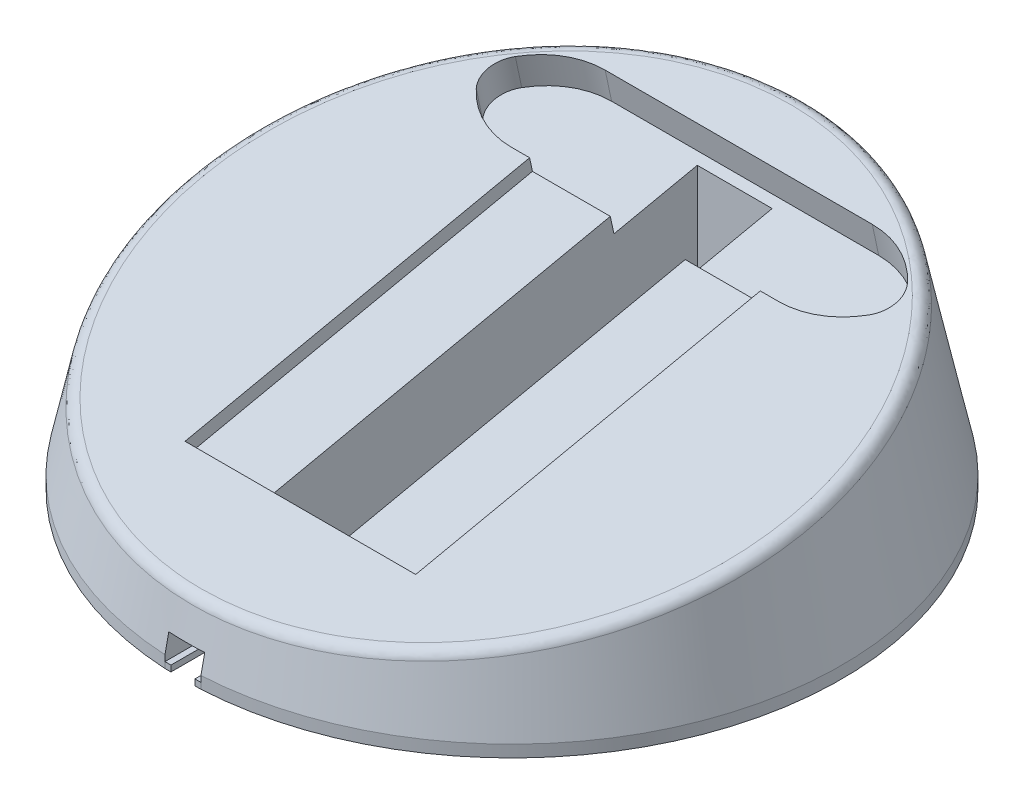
ISO-10303-21;
HEADER;
FILE_DESCRIPTION(('STEP AP214'),'2;1');
FILE_NAME('part.step','',(''),(''),'','','');
FILE_SCHEMA(('AUTOMOTIVE_DESIGN { 1 0 10303 214 1 1 1 1 }'));
ENDSEC;
DATA;
#1=APPLICATION_CONTEXT('core data for automotive mechanical design processes');
#2=APPLICATION_PROTOCOL_DEFINITION('international standard','automotive_design',2000,#1);
#3=PRODUCT_CONTEXT('',#1,'mechanical');
#4=PRODUCT('Part','Part','',(#3));
#5=PRODUCT_RELATED_PRODUCT_CATEGORY('part','',(#4));
#6=PRODUCT_DEFINITION_FORMATION('','',#4);
#7=PRODUCT_DEFINITION_CONTEXT('part definition',#1,'design');
#8=PRODUCT_DEFINITION('design','',#6,#7);
#9=PRODUCT_DEFINITION_SHAPE('','',#8);
#10=(LENGTH_UNIT() NAMED_UNIT(*) SI_UNIT(.MILLI.,.METRE.));
#11=(NAMED_UNIT(*) PLANE_ANGLE_UNIT() SI_UNIT($,.RADIAN.));
#12=(NAMED_UNIT(*) SI_UNIT($,.STERADIAN.) SOLID_ANGLE_UNIT());
#13=UNCERTAINTY_MEASURE_WITH_UNIT(LENGTH_MEASURE(1.E-05),#10,'distance_accuracy_value','');
#14=(GEOMETRIC_REPRESENTATION_CONTEXT(3) GLOBAL_UNCERTAINTY_ASSIGNED_CONTEXT((#13)) GLOBAL_UNIT_ASSIGNED_CONTEXT((#10,
#11,#12)) REPRESENTATION_CONTEXT('',''));
#15=CARTESIAN_POINT('',(0.,0.,0.));
#16=DIRECTION('',(0.,0.,1.));
#17=DIRECTION('',(1.,0.,0.));
#18=AXIS2_PLACEMENT_3D('',#15,#16,#17);
#19=CARTESIAN_POINT('',(3.,0.,0.));
#20=DIRECTION('',(-1.,0.,0.));
#21=DIRECTION('',(0.,0.,1.));
#22=AXIS2_PLACEMENT_3D('',#19,#20,#21);
#23=PLANE('',#22);
#24=DIRECTION('',(0.,0.,-1.));
#25=VECTOR('',#24,1.);
#26=CARTESIAN_POINT('',(3.,-2.,35.3201430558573));
#27=LINE('',#26,#25);
#28=CARTESIAN_POINT('',(3.,-2.,43.5039073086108));
#29=VERTEX_POINT('',#28);
#30=CARTESIAN_POINT('',(3.,-2.,35.3201430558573));
#31=VERTEX_POINT('',#30);
#32=EDGE_CURVE('E541',#29,#31,#27,.T.);
#33=ORIENTED_EDGE('',*,*,#32,.F.);
#34=DIRECTION('',(0.,-1.,0.));
#35=VECTOR('',#34,1.);
#36=CARTESIAN_POINT('',(3.,0.,43.5039073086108));
#37=LINE('',#36,#35);
#38=CARTESIAN_POINT('',(3.,-1.,43.5039073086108));
#39=VERTEX_POINT('',#38);
#40=EDGE_CURVE('E294',#29,#39,#37,.F.);
#41=ORIENTED_EDGE('',*,*,#40,.T.);
#42=DIRECTION('',(0.,0.,-1.));
#43=VECTOR('',#42,1.);
#44=CARTESIAN_POINT('',(3.,-1.,54.9181208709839));
#45=LINE('',#44,#43);
#46=CARTESIAN_POINT('',(3.,-1.,54.9181208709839));
#47=VERTEX_POINT('',#46);
#48=EDGE_CURVE('E271',#47,#39,#45,.T.);
#49=ORIENTED_EDGE('',*,*,#48,.F.);
#50=DIRECTION('',(0.,1.,0.));
#51=VECTOR('',#50,1.);
#52=CARTESIAN_POINT('',(3.,-2.,54.9181208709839));
#53=LINE('',#52,#51);
#54=CARTESIAN_POINT('',(3.,0.,54.9181208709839));
#55=VERTEX_POINT('',#54);
#56=EDGE_CURVE('E288',#47,#55,#53,.T.);
#57=ORIENTED_EDGE('',*,*,#56,.T.);
#58=CARTESIAN_POINT('',(3.,-39.3133384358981,63.2852413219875));
#59=CARTESIAN_POINT('',(3.,-32.3614544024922,61.8059104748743));
#60=CARTESIAN_POINT('',(3.,-25.4095928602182,60.3264739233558));
#61=CARTESIAN_POINT('',(3.,-11.5059290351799,57.3673224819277));
#62=CARTESIAN_POINT('',(3.,-4.55412675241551,55.8876075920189));
#63=CARTESIAN_POINT('',(3.,9.34940432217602,52.9278325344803));
#64=CARTESIAN_POINT('',(3.,16.3011331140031,51.4477723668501));
#65=CARTESIAN_POINT('',(3.,30.2044936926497,48.4871963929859));
#66=CARTESIAN_POINT('',(3.,37.1561254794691,47.0066805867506));
#67=CARTESIAN_POINT('',(3.,44.1076969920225,45.5258817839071));
#68=B_SPLINE_CURVE_WITH_KNOTS('',3,(#58,#59,#60,#61,#62,#63,#64,#65,#66,#67),.UNSPECIFIED.,.F.,
.F.,(4,2,2,2,4),(0.,21.3226171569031,42.6452342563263,63.9678513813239,85.29046856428),.UNSPECIFIED.);
#69=CARTESIAN_POINT('',(3.,3.,54.2794892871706));
#70=VERTEX_POINT('',#69);
#71=EDGE_CURVE('E287',#55,#70,#68,.T.);
#72=ORIENTED_EDGE('',*,*,#71,.T.);
#73=DIRECTION('',(0.,0.,1.));
#74=VECTOR('',#73,1.);
#75=CARTESIAN_POINT('',(3.,3.,55.));
#76=LINE('',#75,#74);
#77=CARTESIAN_POINT('',(3.,3.,50.));
#78=VERTEX_POINT('',#77);
#79=EDGE_CURVE('E538',#78,#70,#76,.T.);
#80=ORIENTED_EDGE('',*,*,#79,.F.);
#81=DIRECTION('',(0.,-0.366836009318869,0.93028562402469));
#82=VECTOR('',#81,1.);
#83=CARTESIAN_POINT('',(3.,8.,37.3201430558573));
#84=LINE('',#83,#82);
#85=CARTESIAN_POINT('',(3.,8.,37.3201430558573));
#86=VERTEX_POINT('',#85);
#87=EDGE_CURVE('E520',#86,#78,#84,.T.);
#88=ORIENTED_EDGE('',*,*,#87,.F.);
#89=DIRECTION('',(0.,0.,1.));
#90=VECTOR('',#89,1.);
#91=CARTESIAN_POINT('',(3.,8.,35.3201430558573));
#92=LINE('',#91,#90);
#93=CARTESIAN_POINT('',(3.,8.,35.3201430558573));
#94=VERTEX_POINT('',#93);
#95=EDGE_CURVE('E527',#94,#86,#92,.T.);
#96=ORIENTED_EDGE('',*,*,#95,.F.);
#97=DIRECTION('',(0.,1.,0.));
#98=VECTOR('',#97,1.);
#99=CARTESIAN_POINT('',(3.,8.,35.3201430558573));
#100=LINE('',#99,#98);
#101=EDGE_CURVE('E543',#31,#94,#100,.T.);
#102=ORIENTED_EDGE('',*,*,#101,.F.);
#103=EDGE_LOOP('',(#33,#41,#49,#57,#72,#80,#88,#96,#102));
#104=FACE_BOUND('',#103,.T.);
#105=ADVANCED_FACE('F33',(#104),#23,.T.);
#106=CARTESIAN_POINT('',(-55.01,32.1432602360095,-55.1121502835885));
#107=DIRECTION('',(0.,0.978147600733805,0.207911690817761));
#108=DIRECTION('',(0.,-0.207911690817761,0.978147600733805));
#109=AXIS2_PLACEMENT_3D('',#106,#107,#108);
#110=PLANE('',#109);
#111=DIRECTION('',(1.,0.,0.));
#112=VECTOR('',#111,1.);
#113=CARTESIAN_POINT('',(-22.2917960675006,25.1467658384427,-22.1962320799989));
#114=LINE('',#113,#112);
#115=CARTESIAN_POINT('',(-22.2917960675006,25.1467658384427,-22.1962320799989));
#116=VERTEX_POINT('',#115);
#117=CARTESIAN_POINT('',(-19.25,25.1467658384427,-22.1962320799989));
#118=VERTEX_POINT('',#117);
#119=EDGE_CURVE('E661',#116,#118,#114,.T.);
#120=ORIENTED_EDGE('',*,*,#119,.F.);
#121=CARTESIAN_POINT('',(-22.2917960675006,28.0575295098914,-35.8902984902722));
#122=DIRECTION('',(0.,0.978147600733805,0.207911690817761));
#123=DIRECTION('',(0.,0.207911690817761,-0.978147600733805));
#124=AXIS2_PLACEMENT_3D('',#121,#122,#123);
#125=CIRCLE('',#124,14.);
#126=CARTESIAN_POINT('',(-32.7267799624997,26.1170203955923,-26.7609208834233));
#127=VERTEX_POINT('',#126);
#128=EDGE_CURVE('E662',#127,#116,#125,.T.);
#129=ORIENTED_EDGE('',*,*,#128,.F.);
#130=CARTESIAN_POINT('',(-29.,26.8100593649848,-30.0214128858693));
#131=DIRECTION('',(0.,0.978147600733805,0.207911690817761));
#132=DIRECTION('',(0.,0.207911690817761,-0.978147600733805));
#133=AXIS2_PLACEMENT_3D('',#130,#131,#132);
#134=CIRCLE('',#133,5.00000000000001);
#135=CARTESIAN_POINT('',(-32.7267799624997,27.5030983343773,-33.2819048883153));
#136=VERTEX_POINT('',#135);
#137=EDGE_CURVE('E681',#136,#127,#134,.T.);
#138=ORIENTED_EDGE('',*,*,#137,.F.);
#139=CARTESIAN_POINT('',(-22.2917960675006,25.5625892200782,-24.1525272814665));
#140=DIRECTION('',(0.,0.978147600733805,0.207911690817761));
#141=DIRECTION('',(0.,-0.207911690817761,0.978147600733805));
#142=AXIS2_PLACEMENT_3D('',#139,#140,#141);
#143=CIRCLE('',#142,14.);
#144=CARTESIAN_POINT('',(-22.2917960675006,28.4733528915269,-37.8465936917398));
#145=VERTEX_POINT('',#144);
#146=EDGE_CURVE('E678',#145,#136,#143,.T.);
#147=ORIENTED_EDGE('',*,*,#146,.F.);
#148=DIRECTION('',(-1.,0.,0.));
#149=VECTOR('',#148,1.);
#150=CARTESIAN_POINT('',(-22.2917960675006,28.4733528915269,-37.8465936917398));
#151=LINE('',#150,#149);
#152=CARTESIAN_POINT('',(22.2917960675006,28.4733528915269,-37.8465936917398));
#153=VERTEX_POINT('',#152);
#154=EDGE_CURVE('E675',#153,#145,#151,.T.);
#155=ORIENTED_EDGE('',*,*,#154,.F.);
#156=CARTESIAN_POINT('',(22.2917960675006,25.5625892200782,-24.1525272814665));
#157=DIRECTION('',(0.,0.978147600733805,0.207911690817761));
#158=DIRECTION('',(0.,0.207911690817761,-0.978147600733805));
#159=AXIS2_PLACEMENT_3D('',#156,#157,#158);
#160=CIRCLE('',#159,14.);
#161=CARTESIAN_POINT('',(32.7267799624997,27.5030983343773,-33.2819048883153));
#162=VERTEX_POINT('',#161);
#163=EDGE_CURVE('E672',#162,#153,#160,.T.);
#164=ORIENTED_EDGE('',*,*,#163,.F.);
#165=CARTESIAN_POINT('',(29.,26.8100593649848,-30.0214128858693));
#166=DIRECTION('',(0.,0.978147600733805,0.207911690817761));
#167=DIRECTION('',(0.,-0.207911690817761,0.978147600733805));
#168=AXIS2_PLACEMENT_3D('',#165,#166,#167);
#169=CIRCLE('',#168,5.);
#170=CARTESIAN_POINT('',(32.7267799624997,26.1170203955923,-26.7609208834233));
#171=VERTEX_POINT('',#170);
#172=EDGE_CURVE('E669',#171,#162,#169,.T.);
#173=ORIENTED_EDGE('',*,*,#172,.F.);
#174=CARTESIAN_POINT('',(22.2917960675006,28.0575295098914,-35.8902984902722));
#175=DIRECTION('',(0.,0.978147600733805,0.207911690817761));
#176=DIRECTION('',(0.,-0.207911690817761,0.978147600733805));
#177=AXIS2_PLACEMENT_3D('',#174,#175,#176);
#178=CIRCLE('',#177,14.);
#179=CARTESIAN_POINT('',(22.2917960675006,25.1467658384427,-22.1962320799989));
#180=VERTEX_POINT('',#179);
#181=EDGE_CURVE('E657',#180,#171,#178,.T.);
#182=ORIENTED_EDGE('',*,*,#181,.F.);
#183=CARTESIAN_POINT('',(19.25,25.1467658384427,-22.1962320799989));
#184=VERTEX_POINT('',#183);
#185=EDGE_CURVE('E654',#184,#180,#114,.T.);
#186=ORIENTED_EDGE('',*,*,#185,.F.);
#187=DIRECTION('',(0.,-0.207911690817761,0.978147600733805));
#188=VECTOR('',#187,1.);
#189=CARTESIAN_POINT('',(19.25,25.1467658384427,-22.1962320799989));
#190=LINE('',#189,#188);
#191=CARTESIAN_POINT('',(19.25,12.9212828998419,35.3201430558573));
#192=VERTEX_POINT('',#191);
#193=EDGE_CURVE('E640',#184,#192,#190,.T.);
#194=ORIENTED_EDGE('',*,*,#193,.T.);
#195=DIRECTION('',(-1.,0.,0.));
#196=VECTOR('',#195,1.);
#197=CARTESIAN_POINT('',(-55.01,12.9212828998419,35.3201430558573));
#198=LINE('',#197,#196);
#199=CARTESIAN_POINT('',(-19.25,12.9212828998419,35.3201430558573));
#200=VERTEX_POINT('',#199);
#201=EDGE_CURVE('E581',#192,#200,#198,.T.);
#202=ORIENTED_EDGE('',*,*,#201,.T.);
#203=DIRECTION('',(0.,-0.207911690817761,0.978147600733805));
#204=VECTOR('',#203,1.);
#205=CARTESIAN_POINT('',(-19.25,25.1467658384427,-22.1962320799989));
#206=LINE('',#205,#204);
#207=EDGE_CURVE('E627',#118,#200,#206,.T.);
#208=ORIENTED_EDGE('',*,*,#207,.F.);
#209=EDGE_LOOP('',(#120,#129,#138,#147,#155,#164,#173,#182,#186,#194,#202,#208));
#210=FACE_BOUND('',#209,.T.);
#211=CARTESIAN_POINT('',(0.,19.8684390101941,2.63634324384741));
#212=DIRECTION('',(0.,0.978147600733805,0.207911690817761));
#213=DIRECTION('',(0.,-0.207911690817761,0.978147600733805));
#214=AXIS2_PLACEMENT_3D('',#211,#212,#213);
#215=ELLIPSE('',#214,50.2459701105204,49.0977876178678);
#216=CARTESIAN_POINT('',(0.,9.42171440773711,51.7843183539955));
#217=VERTEX_POINT('',#216);
#218=EDGE_CURVE('E585',#217,#217,#215,.T.);
#219=ORIENTED_EDGE('',*,*,#218,.T.);
#220=EDGE_LOOP('',(#219));
#221=FACE_BOUND('',#220,.T.);
#222=ADVANCED_FACE('F326',(#210,#221),#110,.T.);
#223=CARTESIAN_POINT('',(0.,-2.,0.));
#224=DIRECTION('',(0.,-1.,0.));
#225=DIRECTION('',(0.,0.,-1.));
#226=AXIS2_PLACEMENT_3D('',#223,#224,#225);
#227=PLANE('',#226);
#228=CARTESIAN_POINT('',(35.2380443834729,-2.,29.568230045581));
#229=DIRECTION('',(0.,1.,0.));
#230=DIRECTION('',(0.,0.,-1.));
#231=AXIS2_PLACEMENT_3D('',#228,#229,#230);
#232=CIRCLE('',#231,6.6);
#233=CARTESIAN_POINT('',(35.2380443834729,-2.,22.968230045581));
#234=VERTEX_POINT('',#233);
#235=EDGE_CURVE('E782',#234,#234,#232,.T.);
#236=ORIENTED_EDGE('',*,*,#235,.T.);
#237=EDGE_LOOP('',(#236));
#238=FACE_BOUND('',#237,.T.);
#239=CARTESIAN_POINT('',(15.7329265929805,-2.,-43.2258605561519));
#240=DIRECTION('',(0.,1.,0.));
#241=DIRECTION('',(0.,0.,-1.));
#242=AXIS2_PLACEMENT_3D('',#239,#240,#241);
#243=CIRCLE('',#242,6.6);
#244=CARTESIAN_POINT('',(15.7329265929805,-2.,-49.8258605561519));
#245=VERTEX_POINT('',#244);
#246=EDGE_CURVE('E793',#245,#245,#243,.T.);
#247=ORIENTED_EDGE('',*,*,#246,.T.);
#248=EDGE_LOOP('',(#247));
#249=FACE_BOUND('',#248,.T.);
#250=CARTESIAN_POINT('',(-35.2380443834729,-2.,29.568230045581));
#251=DIRECTION('',(0.,-1.,0.));
#252=DIRECTION('',(0.,0.,-1.));
#253=AXIS2_PLACEMENT_3D('',#250,#251,#252);
#254=CIRCLE('',#253,6.6);
#255=CARTESIAN_POINT('',(-35.2380443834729,-2.,22.968230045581));
#256=VERTEX_POINT('',#255);
#257=EDGE_CURVE('E510',#256,#256,#254,.T.);
#258=ORIENTED_EDGE('',*,*,#257,.F.);
#259=EDGE_LOOP('',(#258));
#260=FACE_BOUND('',#259,.T.);
#261=CARTESIAN_POINT('',(-15.7329265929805,-2.,-43.2258605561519));
#262=DIRECTION('',(0.,-1.,0.));
#263=DIRECTION('',(0.,0.,-1.));
#264=AXIS2_PLACEMENT_3D('',#261,#262,#263);
#265=CIRCLE('',#264,6.6);
#266=CARTESIAN_POINT('',(-15.7329265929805,-2.,-49.8258605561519));
#267=VERTEX_POINT('',#266);
#268=EDGE_CURVE('E514',#267,#267,#265,.T.);
#269=ORIENTED_EDGE('',*,*,#268,.F.);
#270=EDGE_LOOP('',(#269));
#271=FACE_BOUND('',#270,.T.);
#272=DIRECTION('',(0.,0.,1.));
#273=VECTOR('',#272,1.);
#274=CARTESIAN_POINT('',(2.,-2.,54.9181208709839));
#275=LINE('',#274,#273);
#276=CARTESIAN_POINT('',(2.,-2.,45.332334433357));
#277=VERTEX_POINT('',#276);
#278=CARTESIAN_POINT('',(2.,-2.,54.9181208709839));
#279=VERTEX_POINT('',#278);
#280=EDGE_CURVE('E787',#277,#279,#275,.T.);
#281=ORIENTED_EDGE('',*,*,#280,.F.);
#282=CARTESIAN_POINT('',(3.,-2.,45.332334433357));
#283=DIRECTION('',(0.,-1.,0.));
#284=DIRECTION('',(0.,0.,-1.));
#285=AXIS2_PLACEMENT_3D('',#282,#283,#284);
#286=CIRCLE('',#285,1.);
#287=CARTESIAN_POINT('',(2.29289321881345,-2.,44.6252276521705));
#288=VERTEX_POINT('',#287);
#289=EDGE_CURVE('E446',#277,#288,#286,.T.);
#290=ORIENTED_EDGE('',*,*,#289,.T.);
#291=DIRECTION('',(-0.707106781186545,0.,0.70710678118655));
#292=VECTOR('',#291,1.);
#293=CARTESIAN_POINT('',(3.,-2.,43.9181208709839));
#294=LINE('',#293,#292);
#295=CARTESIAN_POINT('',(2.70710678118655,-2.,44.2110140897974));
#296=VERTEX_POINT('',#295);
#297=EDGE_CURVE('E296',#296,#288,#294,.T.);
#298=ORIENTED_EDGE('',*,*,#297,.F.);
#299=CARTESIAN_POINT('',(2.,-2.,43.5039073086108));
#300=DIRECTION('',(0.,-1.,0.));
#301=DIRECTION('',(0.,0.,-1.));
#302=AXIS2_PLACEMENT_3D('',#299,#300,#301);
#303=CIRCLE('',#302,1.);
#304=EDGE_CURVE('E466',#296,#29,#303,.F.);
#305=ORIENTED_EDGE('',*,*,#304,.T.);
#306=ORIENTED_EDGE('',*,*,#32,.T.);
#307=DIRECTION('',(1.,0.,0.));
#308=VECTOR('',#307,1.);
#309=CARTESIAN_POINT('',(-6.25000000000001,-2.,35.3201430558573));
#310=LINE('',#309,#308);
#311=CARTESIAN_POINT('',(6.25,-2.,35.3201430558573));
#312=VERTEX_POINT('',#311);
#313=EDGE_CURVE('E557',#31,#312,#310,.T.);
#314=ORIENTED_EDGE('',*,*,#313,.T.);
#315=DIRECTION('',(0.,0.,-1.));
#316=VECTOR('',#315,1.);
#317=CARTESIAN_POINT('',(6.25,-2.,35.3201430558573));
#318=LINE('',#317,#316);
#319=CARTESIAN_POINT('',(6.25000000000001,-2.,-37.1798569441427));
#320=VERTEX_POINT('',#319);
#321=EDGE_CURVE('E567',#312,#320,#318,.T.);
#322=ORIENTED_EDGE('',*,*,#321,.T.);
#323=DIRECTION('',(-1.,0.,0.));
#324=VECTOR('',#323,1.);
#325=CARTESIAN_POINT('',(6.25000000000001,-2.,-37.1798569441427));
#326=LINE('',#325,#324);
#327=CARTESIAN_POINT('',(-6.25,-2.,-37.1798569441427));
#328=VERTEX_POINT('',#327);
#329=EDGE_CURVE('E569',#320,#328,#326,.T.);
#330=ORIENTED_EDGE('',*,*,#329,.T.);
#331=DIRECTION('',(0.,0.,1.));
#332=VECTOR('',#331,1.);
#333=CARTESIAN_POINT('',(-6.25,-2.,-37.1798569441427));
#334=LINE('',#333,#332);
#335=CARTESIAN_POINT('',(-6.25000000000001,-2.,35.3201430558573));
#336=VERTEX_POINT('',#335);
#337=EDGE_CURVE('E565',#328,#336,#334,.T.);
#338=ORIENTED_EDGE('',*,*,#337,.T.);
#339=CARTESIAN_POINT('',(-3.,-2.,35.3201430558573));
#340=VERTEX_POINT('',#339);
#341=EDGE_CURVE('E564',#336,#340,#310,.T.);
#342=ORIENTED_EDGE('',*,*,#341,.T.);
#343=DIRECTION('',(0.,0.,-1.));
#344=VECTOR('',#343,1.);
#345=CARTESIAN_POINT('',(-3.,-2.,35.3201430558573));
#346=LINE('',#345,#344);
#347=CARTESIAN_POINT('',(-3.,-2.,43.5039073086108));
#348=VERTEX_POINT('',#347);
#349=EDGE_CURVE('E476',#348,#340,#346,.T.);
#350=ORIENTED_EDGE('',*,*,#349,.F.);
#351=CARTESIAN_POINT('',(-2.,-2.,43.5039073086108));
#352=DIRECTION('',(0.,-1.,0.));
#353=DIRECTION('',(0.,0.,-1.));
#354=AXIS2_PLACEMENT_3D('',#351,#352,#353);
#355=CIRCLE('',#354,1.);
#356=CARTESIAN_POINT('',(-2.70710678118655,-2.,44.2110140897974));
#357=VERTEX_POINT('',#356);
#358=EDGE_CURVE('E41',#348,#357,#355,.F.);
#359=ORIENTED_EDGE('',*,*,#358,.T.);
#360=DIRECTION('',(0.707106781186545,0.,0.70710678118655));
#361=VECTOR('',#360,1.);
#362=CARTESIAN_POINT('',(-3.,-2.,43.9181208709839));
#363=LINE('',#362,#361);
#364=CARTESIAN_POINT('',(-2.29289321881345,-2.,44.6252276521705));
#365=VERTEX_POINT('',#364);
#366=EDGE_CURVE('E474',#357,#365,#363,.T.);
#367=ORIENTED_EDGE('',*,*,#366,.T.);
#368=CARTESIAN_POINT('',(-3.,-2.,45.332334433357));
#369=DIRECTION('',(0.,-1.,0.));
#370=DIRECTION('',(0.,0.,-1.));
#371=AXIS2_PLACEMENT_3D('',#368,#369,#370);
#372=CIRCLE('',#371,1.);
#373=CARTESIAN_POINT('',(-2.,-2.,45.332334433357));
#374=VERTEX_POINT('',#373);
#375=EDGE_CURVE('E444',#365,#374,#372,.T.);
#376=ORIENTED_EDGE('',*,*,#375,.T.);
#377=DIRECTION('',(0.,0.,1.));
#378=VECTOR('',#377,1.);
#379=CARTESIAN_POINT('',(-2.,-2.,54.9181208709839));
#380=LINE('',#379,#378);
#381=CARTESIAN_POINT('',(-2.,-2.,54.9181208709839));
#382=VERTEX_POINT('',#381);
#383=EDGE_CURVE('E485',#374,#382,#380,.T.);
#384=ORIENTED_EDGE('',*,*,#383,.T.);
#385=DIRECTION('',(-1.,0.,0.));
#386=VECTOR('',#385,1.);
#387=CARTESIAN_POINT('',(-3.,-2.,54.9181208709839));
#388=LINE('',#387,#386);
#389=CARTESIAN_POINT('',(-3.,-2.,54.9181208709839));
#390=VERTEX_POINT('',#389);
#391=EDGE_CURVE('E499',#382,#390,#388,.T.);
#392=ORIENTED_EDGE('',*,*,#391,.T.);
#393=CARTESIAN_POINT('',(0.,-2.,0.));
#394=DIRECTION('',(0.,-1.,0.));
#395=DIRECTION('',(0.,0.,-1.));
#396=AXIS2_PLACEMENT_3D('',#393,#394,#395);
#397=CIRCLE('',#396,55.);
#398=CARTESIAN_POINT('',(3.,-2.,54.9181208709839));
#399=VERTEX_POINT('',#398);
#400=EDGE_CURVE('E583',#390,#399,#397,.T.);
#401=ORIENTED_EDGE('',*,*,#400,.T.);
#402=DIRECTION('',(1.,0.,0.));
#403=VECTOR('',#402,1.);
#404=CARTESIAN_POINT('',(3.,-2.,54.9181208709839));
#405=LINE('',#404,#403);
#406=EDGE_CURVE('E283',#279,#399,#405,.T.);
#407=ORIENTED_EDGE('',*,*,#406,.F.);
#408=EDGE_LOOP('',(#281,#290,#298,#305,#306,#314,#322,#330,#338,#342,#350,#359,#367,#376,#384,
#392,#401,#407));
#409=FACE_BOUND('',#408,.T.);
#410=ADVANCED_FACE('F409',(#238,#249,#260,#271,#409),#227,.T.);
#411=CARTESIAN_POINT('',(0.,0.,0.));
#412=DIRECTION('',(0.,-1.,0.));
#413=DIRECTION('',(0.,0.,1.));
#414=AXIS2_PLACEMENT_3D('',#411,#412,#413);
#415=CONICAL_SURFACE('',#414,55.,0.20943951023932);
#416=CARTESIAN_POINT('',(0.,7.88124258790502,53.3247901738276));
#417=CARTESIAN_POINT('',(0.,9.15167554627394,53.0547513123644));
#418=CARTESIAN_POINT('',(0.,9.4217144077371,51.7843183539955));
#419=CARTESIAN_POINT('',(2.22417557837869,7.88124258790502,53.3247901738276));
#420=CARTESIAN_POINT('',(2.20057978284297,9.15167554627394,53.0547513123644));
#421=CARTESIAN_POINT('',(2.1425784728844,9.4217144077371,51.7843183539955));
#422=CARTESIAN_POINT('',(4.44835115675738,7.91113505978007,53.1790452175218));
#423=CARTESIAN_POINT('',(4.40199078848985,9.18222736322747,52.9110163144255));
#424=CARTESIAN_POINT('',(4.2851569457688,9.45160687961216,51.6436853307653));
#425=CARTESIAN_POINT('',(8.85880535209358,8.03014398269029,52.598777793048));
#426=CARTESIAN_POINT('',(8.76599957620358,9.30378063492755,52.3391531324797));
#427=CARTESIAN_POINT('',(8.53363371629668,9.57061580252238,51.0837923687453));
#428=CARTESIAN_POINT('',(11.0450522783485,8.1193077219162,52.1640247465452));
#429=CARTESIAN_POINT('',(10.930175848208,9.39492172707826,51.9103680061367));
#430=CARTESIAN_POINT('',(10.6395013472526,9.65977954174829,50.6643099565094));
#431=CARTESIAN_POINT('',(15.3424564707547,8.35528604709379,51.0133449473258));
#432=CARTESIAN_POINT('',(15.1833508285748,9.63599099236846,50.7762262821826));
#433=CARTESIAN_POINT('',(14.7785685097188,9.89575786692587,49.5541192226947));
#434=CARTESIAN_POINT('',(17.4534929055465,8.5021892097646,50.2969861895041));
#435=CARTESIAN_POINT('',(17.273684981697,9.78618725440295,50.069608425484));
#436=CARTESIAN_POINT('',(16.811651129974,10.0426610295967,48.862994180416));
#437=CARTESIAN_POINT('',(21.5646056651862,8.85109335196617,48.5954379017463));
#438=CARTESIAN_POINT('',(21.3441875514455,10.1427322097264,48.3921962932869));
#439=CARTESIAN_POINT('',(20.7704605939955,10.3915651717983,47.2215292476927));
#440=CARTESIAN_POINT('',(23.5644311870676,9.05321323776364,47.6096682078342));
#441=CARTESIAN_POINT('',(23.325314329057,10.3494564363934,47.4196352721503));
#442=CARTESIAN_POINT('',(22.6959448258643,10.5936850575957,46.2706299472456));
#443=CARTESIAN_POINT('',(27.4191606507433,9.50906573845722,45.3861549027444));
#444=CARTESIAN_POINT('',(27.1443431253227,10.8155015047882,45.2270656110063));
#445=CARTESIAN_POINT('',(26.4067463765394,11.0495375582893,44.1260125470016));
#446=CARTESIAN_POINT('',(29.2736670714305,9.7629335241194,44.1477513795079));
#447=CARTESIAN_POINT('',(28.9827297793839,11.0752769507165,44.004918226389));
#448=CARTESIAN_POINT('',(28.1916792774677,11.3034053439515,42.9316585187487));
#449=CARTESIAN_POINT('',(32.8062552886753,10.3179265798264,41.4400499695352));
#450=CARTESIAN_POINT('',(32.4856595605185,11.6430110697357,41.3339391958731));
#451=CARTESIAN_POINT('',(31.5909817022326,11.8583983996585,40.320621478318));
#452=CARTESIAN_POINT('',(34.4838031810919,10.619188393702,39.9700849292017));
#453=CARTESIAN_POINT('',(34.1501612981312,11.9514707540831,39.8827504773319));
#454=CARTESIAN_POINT('',(33.2048351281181,12.1596602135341,38.9032960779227));
#455=CARTESIAN_POINT('',(37.6339373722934,11.2638187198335,36.8242115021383));
#456=CARTESIAN_POINT('',(37.2776087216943,12.6113771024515,36.7781352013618));
#457=CARTESIAN_POINT('',(36.2344918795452,12.8042905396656,35.8705488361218));
#458=CARTESIAN_POINT('',(39.1058891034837,11.6073116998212,35.1476943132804));
#459=CARTESIAN_POINT('',(38.7399802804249,12.9633374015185,35.1222921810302));
#460=CARTESIAN_POINT('',(37.6496821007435,13.1477835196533,34.254541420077));
#461=CARTESIAN_POINT('',(41.8197219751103,12.330544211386,31.6171327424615));
#462=CARTESIAN_POINT('',(41.4387795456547,13.7043504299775,31.6360999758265));
#463=CARTESIAN_POINT('',(40.2578832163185,13.8710160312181,30.8519999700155));
#464=CARTESIAN_POINT('',(43.06092329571,12.7103860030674,29.7625874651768));
#465=CARTESIAN_POINT('',(42.6741356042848,14.0938973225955,29.8034259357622));
#466=CARTESIAN_POINT('',(41.4502376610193,14.2508578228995,29.0649848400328));
#467=CARTESIAN_POINT('',(45.2919863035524,13.4998433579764,25.9073937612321));
#468=CARTESIAN_POINT('',(44.8982093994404,14.9035840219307,25.9941495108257));
#469=CARTESIAN_POINT('',(43.5923916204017,15.0403151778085,25.3508799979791));
#470=CARTESIAN_POINT('',(46.2811896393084,13.9095333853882,23.9063798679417));
#471=CARTESIAN_POINT('',(45.8854280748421,15.3241702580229,24.0154468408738));
#472=CARTESIAN_POINT('',(44.5415558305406,15.4500052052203,23.4234399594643));
#473=CARTESIAN_POINT('',(47.9911848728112,14.7517080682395,19.7921767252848));
#474=CARTESIAN_POINT('',(47.5965419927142,16.1889322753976,19.9470614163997));
#475=CARTESIAN_POINT('',(46.1810470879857,16.2921798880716,19.4613195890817));
#476=CARTESIAN_POINT('',(48.7114083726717,15.1842388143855,17.6787605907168));
#477=CARTESIAN_POINT('',(48.3186070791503,16.6334837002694,17.8556113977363));
#478=CARTESIAN_POINT('',(46.8708260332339,16.7247106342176,17.426422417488));
#479=CARTESIAN_POINT('',(49.8708665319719,16.0647241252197,13.3756379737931));
#480=CARTESIAN_POINT('',(49.4869985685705,17.5387767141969,13.5965426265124));
#481=CARTESIAN_POINT('',(47.9796360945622,17.6051959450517,13.2840647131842));
#482=CARTESIAN_POINT('',(50.3096837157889,16.5127005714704,11.1858232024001));
#483=CARTESIAN_POINT('',(49.9312774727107,17.9998059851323,11.427570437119));
#484=CARTESIAN_POINT('',(48.398264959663,18.0531723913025,11.1765012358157));
#485=CARTESIAN_POINT('',(50.8984774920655,17.4164366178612,6.76716206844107));
#486=CARTESIAN_POINT('',(50.5361533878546,18.9303726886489,7.04959830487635));
#487=CARTESIAN_POINT('',(48.9574470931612,18.9569084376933,6.92475742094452));
#488=CARTESIAN_POINT('',(51.048233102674,17.8722019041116,4.5382871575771));
#489=CARTESIAN_POINT('',(50.6946089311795,19.4000986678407,4.8397113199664));
#490=CARTESIAN_POINT('',(49.0977876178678,19.4126737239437,4.78055033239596));
#491=CARTESIAN_POINT('',(51.0559371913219,18.7837324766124,0.079524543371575));
#492=CARTESIAN_POINT('',(50.7245086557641,20.3402118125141,0.416826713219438));
#493=CARTESIAN_POINT('',(49.0977876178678,20.3242042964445,0.492136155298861));
#494=CARTESIAN_POINT('',(50.9138856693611,19.2394977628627,-2.15036315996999));
#495=CARTESIAN_POINT('',(50.5938440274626,20.8106830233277,-1.79656631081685));
#496=CARTESIAN_POINT('',(48.9574470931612,20.7799695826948,-1.65207093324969));
#497=CARTESIAN_POINT('',(50.339976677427,20.1432338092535,-6.57300846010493));
#498=CARTESIAN_POINT('',(50.046867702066,21.7443952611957,-6.18933701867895));
#499=CARTESIAN_POINT('',(48.398264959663,21.6837056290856,-5.9038147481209));
#500=CARTESIAN_POINT('',(49.9083405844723,20.5912102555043,-8.765793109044));
#501=CARTESIAN_POINT('',(49.6286047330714,22.2076159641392,-8.36861908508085));
#502=CARTESIAN_POINT('',(47.9796360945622,22.1316820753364,-8.01137822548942));
#503=CARTESIAN_POINT('',(48.7622322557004,21.4716955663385,-13.0766142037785));
#504=CARTESIAN_POINT('',(48.5125078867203,23.1190136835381,-12.6564082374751));
#505=CARTESIAN_POINT('',(46.8708260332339,23.0121673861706,-12.1537359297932));
#506=CARTESIAN_POINT('',(48.0481789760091,21.9042263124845,-15.1947563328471));
#507=CARTESIAN_POINT('',(47.8129992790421,23.567071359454,-14.7643538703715));
#508=CARTESIAN_POINT('',(46.1810470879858,23.4446981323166,-14.1886331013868));
#509=CARTESIAN_POINT('',(46.3490904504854,22.7464009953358,-19.3198505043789));
#510=CARTESIAN_POINT('',(46.1451556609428,24.4405302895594,-18.8736550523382));
#511=CARTESIAN_POINT('',(44.5415558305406,24.2868728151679,-18.1507534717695));
#512=CARTESIAN_POINT('',(45.3646265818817,23.1560910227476,-21.3270263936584));
#513=CARTESIAN_POINT('',(45.1755316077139,24.8657235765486,-20.8740321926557));
#514=CARTESIAN_POINT('',(43.5923916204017,24.6965628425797,-20.0781935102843));
#515=CARTESIAN_POINT('',(43.141283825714,23.9455483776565,-25.1955648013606));
#516=CARTESIAN_POINT('',(42.9827647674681,25.6861645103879,-24.7339033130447));
#517=CARTESIAN_POINT('',(41.4502376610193,25.4860201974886,-23.792298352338));
#518=CARTESIAN_POINT('',(41.903067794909,24.325390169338,-27.0572901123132));
#519=CARTESIAN_POINT('',(41.7588133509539,26.0811308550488,-26.592073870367));
#520=CARTESIAN_POINT('',(40.2578832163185,25.86586198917,-25.5793134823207));
#521=CARTESIAN_POINT('',(39.193240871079,25.0486226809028,-30.6027435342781));
#522=CARTESIAN_POINT('',(39.0770943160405,26.8342742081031,-30.1353347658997));
#523=CARTESIAN_POINT('',(37.6496821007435,26.5890945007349,-28.9818549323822));
#524=CARTESIAN_POINT('',(37.7223154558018,25.3921156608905,-32.2869709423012));
#525=CARTESIAN_POINT('',(37.6190731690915,27.1921165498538,-31.8188506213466));
#526=CARTESIAN_POINT('',(36.2344918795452,26.9325874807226,-30.597862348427));
#527=CARTESIAN_POINT('',(34.572196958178,26.036745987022,-35.4482701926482));
#528=CARTESIAN_POINT('',(34.4930767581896,27.8647343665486,-34.9832686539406));
#529=CARTESIAN_POINT('',(33.2048351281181,27.577217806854,-33.6306095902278));
#530=CARTESIAN_POINT('',(32.8936445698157,26.3380078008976,-36.9259507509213));
#531=CARTESIAN_POINT('',(32.8254510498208,28.1791459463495,-36.4624588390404));
#532=CARTESIAN_POINT('',(31.5909817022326,27.8784796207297,-35.0479349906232));
#533=CARTESIAN_POINT('',(29.3570773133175,26.8930008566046,-39.648560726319));
#534=CARTESIAN_POINT('',(29.307958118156,28.7593091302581,-39.1919120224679));
#535=CARTESIAN_POINT('',(28.1916792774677,28.4334726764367,-37.6589720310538));
#536=CARTESIAN_POINT('',(27.4996021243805,27.1468686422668,-40.8941587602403));
#537=CARTESIAN_POINT('',(27.45905775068,29.0246948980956,-40.4404538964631));
#538=CARTESIAN_POINT('',(26.4067463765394,28.6873404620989,-38.8533260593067));
#539=CARTESIAN_POINT('',(23.6371670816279,27.6027211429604,-43.1310457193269));
#540=CARTESIAN_POINT('',(23.6101870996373,29.5020117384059,-42.6860530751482));
#541=CARTESIAN_POINT('',(22.6959448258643,29.1431929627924,-40.9979434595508));
#542=CARTESIAN_POINT('',(21.6326094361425,27.8048410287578,-44.122997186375));
#543=CARTESIAN_POINT('',(21.6117752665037,29.7136038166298,-43.6815155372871));
#544=CARTESIAN_POINT('',(20.7704605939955,29.3453128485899,-41.9488427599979));
#545=CARTESIAN_POINT('',(17.5105879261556,28.1537451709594,-45.8354699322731));
#546=CARTESIAN_POINT('',(17.4980297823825,30.0794434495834,-45.4026556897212));
#547=CARTESIAN_POINT('',(16.811651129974,29.6942169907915,-43.5903076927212));
#548=CARTESIAN_POINT('',(15.3933780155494,28.3006483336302,-46.5565744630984));
#549=CARTESIAN_POINT('',(15.3847770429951,30.2334068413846,-46.1269964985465));
#550=CARTESIAN_POINT('',(14.7785685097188,29.8411201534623,-44.2814327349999));
#551=CARTESIAN_POINT('',(11.0826052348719,28.5366266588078,-47.7149816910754));
#552=CARTESIAN_POINT('',(11.0778963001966,30.48109863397,-47.2922947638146));
#553=CARTESIAN_POINT('',(10.6395013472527,30.0770984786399,-45.3916234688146));
#554=CARTESIAN_POINT('',(8.8891647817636,28.6257903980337,-48.1527190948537));
#555=CARTESIAN_POINT('',(8.88675997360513,30.5746221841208,-47.7322884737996));
#556=CARTESIAN_POINT('',(8.5336337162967,30.1662622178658,-45.8111058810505));
#557=CARTESIAN_POINT('',(4.46379480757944,28.7447993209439,-48.7369874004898));
#558=CARTESIAN_POINT('',(4.46238691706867,30.6996200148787,-48.3203570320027));
#559=CARTESIAN_POINT('',(4.28515694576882,30.285271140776,-46.3709988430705));
#560=CARTESIAN_POINT('',(2.23189740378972,28.774691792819,-48.8837504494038));
#561=CARTESIAN_POINT('',(2.23190471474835,30.7309869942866,-48.4679270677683));
#562=CARTESIAN_POINT('',(2.14257847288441,30.3151636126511,-46.5116318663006));
#563=CARTESIAN_POINT('',(-2.23189740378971,28.774691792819,-48.8837504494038));
#564=CARTESIAN_POINT('',(-2.23190471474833,30.7309869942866,-48.4679270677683));
#565=CARTESIAN_POINT('',(-2.1425784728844,30.3151636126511,-46.5116318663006));
#566=CARTESIAN_POINT('',(-4.46379480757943,28.7447993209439,-48.7369874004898));
#567=CARTESIAN_POINT('',(-4.46238691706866,30.6996200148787,-48.3203570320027));
#568=CARTESIAN_POINT('',(-4.2851569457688,30.285271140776,-46.3709988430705));
#569=CARTESIAN_POINT('',(-8.88916478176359,28.6257903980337,-48.1527190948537));
#570=CARTESIAN_POINT('',(-8.88675997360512,30.5746221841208,-47.7322884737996));
#571=CARTESIAN_POINT('',(-8.53363371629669,30.1662622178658,-45.8111058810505));
#572=CARTESIAN_POINT('',(-11.0826052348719,28.5366266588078,-47.7149816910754));
#573=CARTESIAN_POINT('',(-11.0778963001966,30.48109863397,-47.2922947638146));
#574=CARTESIAN_POINT('',(-10.6395013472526,30.0770984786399,-45.3916234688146));
#575=CARTESIAN_POINT('',(-15.3933780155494,28.3006483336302,-46.5565744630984));
#576=CARTESIAN_POINT('',(-15.3847770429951,30.2334068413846,-46.1269964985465));
#577=CARTESIAN_POINT('',(-14.7785685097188,29.8411201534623,-44.2814327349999));
#578=CARTESIAN_POINT('',(-17.5105879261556,28.1537451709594,-45.8354699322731));
#579=CARTESIAN_POINT('',(-17.4980297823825,30.0794434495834,-45.4026556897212));
#580=CARTESIAN_POINT('',(-16.811651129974,29.6942169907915,-43.5903076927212));
#581=CARTESIAN_POINT('',(-21.6326094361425,27.8048410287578,-44.122997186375));
#582=CARTESIAN_POINT('',(-21.6117752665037,29.7136038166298,-43.6815155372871));
#583=CARTESIAN_POINT('',(-20.7704605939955,29.3453128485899,-41.9488427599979));
#584=CARTESIAN_POINT('',(-23.6371670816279,27.6027211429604,-43.1310457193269));
#585=CARTESIAN_POINT('',(-23.6101870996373,29.5020117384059,-42.6860530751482));
#586=CARTESIAN_POINT('',(-22.6959448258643,29.1431929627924,-40.9979434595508));
#587=CARTESIAN_POINT('',(-27.4996021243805,27.1468686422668,-40.8941587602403));
#588=CARTESIAN_POINT('',(-27.4590577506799,29.0246948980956,-40.4404538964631));
#589=CARTESIAN_POINT('',(-26.4067463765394,28.6873404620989,-38.8533260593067));
#590=CARTESIAN_POINT('',(-29.3570773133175,26.8930008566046,-39.648560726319));
#591=CARTESIAN_POINT('',(-29.307958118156,28.7593091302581,-39.1919120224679));
#592=CARTESIAN_POINT('',(-28.1916792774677,28.4334726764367,-37.6589720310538));
#593=CARTESIAN_POINT('',(-32.8936445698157,26.3380078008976,-36.9259507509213));
#594=CARTESIAN_POINT('',(-32.8254510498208,28.1791459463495,-36.4624588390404));
#595=CARTESIAN_POINT('',(-31.5909817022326,27.8784796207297,-35.0479349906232));
#596=CARTESIAN_POINT('',(-34.572196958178,26.036745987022,-35.4482701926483));
#597=CARTESIAN_POINT('',(-34.4930767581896,27.8647343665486,-34.9832686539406));
#598=CARTESIAN_POINT('',(-33.2048351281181,27.577217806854,-33.6306095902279));
#599=CARTESIAN_POINT('',(-37.7223154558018,25.3921156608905,-32.2869709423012));
#600=CARTESIAN_POINT('',(-37.6190731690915,27.1921165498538,-31.8188506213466));
#601=CARTESIAN_POINT('',(-36.2344918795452,26.9325874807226,-30.597862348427));
#602=CARTESIAN_POINT('',(-39.193240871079,25.0486226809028,-30.6027435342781));
#603=CARTESIAN_POINT('',(-39.0770943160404,26.8342742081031,-30.1353347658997));
#604=CARTESIAN_POINT('',(-37.6496821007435,26.5890945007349,-28.9818549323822));
#605=CARTESIAN_POINT('',(-41.903067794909,24.325390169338,-27.0572901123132));
#606=CARTESIAN_POINT('',(-41.7588133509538,26.0811308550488,-26.592073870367));
#607=CARTESIAN_POINT('',(-40.2578832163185,25.86586198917,-25.5793134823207));
#608=CARTESIAN_POINT('',(-43.141283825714,23.9455483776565,-25.1955648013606));
#609=CARTESIAN_POINT('',(-42.982764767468,25.6861645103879,-24.7339033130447));
#610=CARTESIAN_POINT('',(-41.4502376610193,25.4860201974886,-23.792298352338));
#611=CARTESIAN_POINT('',(-45.3646265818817,23.1560910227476,-21.3270263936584));
#612=CARTESIAN_POINT('',(-45.1755316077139,24.8657235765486,-20.8740321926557));
#613=CARTESIAN_POINT('',(-43.5923916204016,24.6965628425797,-20.0781935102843));
#614=CARTESIAN_POINT('',(-46.3490904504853,22.7464009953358,-19.3198505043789));
#615=CARTESIAN_POINT('',(-46.1451556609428,24.4405302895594,-18.8736550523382));
#616=CARTESIAN_POINT('',(-44.5415558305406,24.2868728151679,-18.1507534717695));
#617=CARTESIAN_POINT('',(-48.0481789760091,21.9042263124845,-15.1947563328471));
#618=CARTESIAN_POINT('',(-47.8129992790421,23.567071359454,-14.7643538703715));
#619=CARTESIAN_POINT('',(-46.1810470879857,23.4446981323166,-14.1886331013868));
#620=CARTESIAN_POINT('',(-48.7622322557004,21.4716955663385,-13.0766142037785));
#621=CARTESIAN_POINT('',(-48.5125078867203,23.1190136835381,-12.6564082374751));
#622=CARTESIAN_POINT('',(-46.8708260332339,23.0121673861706,-12.1537359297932));
#623=CARTESIAN_POINT('',(-49.9083405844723,20.5912102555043,-8.765793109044));
#624=CARTESIAN_POINT('',(-49.6286047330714,22.2076159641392,-8.36861908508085));
#625=CARTESIAN_POINT('',(-47.9796360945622,22.1316820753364,-8.01137822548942));
#626=CARTESIAN_POINT('',(-50.339976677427,20.1432338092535,-6.57300846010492));
#627=CARTESIAN_POINT('',(-50.046867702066,21.7443952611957,-6.18933701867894));
#628=CARTESIAN_POINT('',(-48.398264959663,21.6837056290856,-5.9038147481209));
#629=CARTESIAN_POINT('',(-50.9138856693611,19.2394977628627,-2.15036315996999));
#630=CARTESIAN_POINT('',(-50.5938440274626,20.8106830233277,-1.79656631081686));
#631=CARTESIAN_POINT('',(-48.9574470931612,20.7799695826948,-1.65207093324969));
#632=CARTESIAN_POINT('',(-51.0559371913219,18.7837324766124,0.0795245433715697));
#633=CARTESIAN_POINT('',(-50.7245086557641,20.3402118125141,0.416826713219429));
#634=CARTESIAN_POINT('',(-49.0977876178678,20.3242042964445,0.492136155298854));
#635=CARTESIAN_POINT('',(-51.048233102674,17.8722019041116,4.53828715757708));
#636=CARTESIAN_POINT('',(-50.6946089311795,19.4000986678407,4.83971131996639));
#637=CARTESIAN_POINT('',(-49.0977876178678,19.4126737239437,4.78055033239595));
#638=CARTESIAN_POINT('',(-50.8984774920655,17.4164366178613,6.76716206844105));
#639=CARTESIAN_POINT('',(-50.5361533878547,18.9303726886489,7.04959830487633));
#640=CARTESIAN_POINT('',(-48.9574470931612,18.9569084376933,6.92475742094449));
#641=CARTESIAN_POINT('',(-50.3096837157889,16.5127005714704,11.1858232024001));
#642=CARTESIAN_POINT('',(-49.9312774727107,17.9998059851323,11.4275704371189));
#643=CARTESIAN_POINT('',(-48.398264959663,18.0531723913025,11.1765012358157));
#644=CARTESIAN_POINT('',(-49.8708665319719,16.0647241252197,13.3756379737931));
#645=CARTESIAN_POINT('',(-49.4869985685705,17.5387767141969,13.5965426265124));
#646=CARTESIAN_POINT('',(-47.9796360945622,17.6051959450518,13.2840647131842));
#647=CARTESIAN_POINT('',(-48.7114083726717,15.1842388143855,17.6787605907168));
#648=CARTESIAN_POINT('',(-48.3186070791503,16.6334837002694,17.8556113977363));
#649=CARTESIAN_POINT('',(-46.870826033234,16.7247106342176,17.426422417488));
#650=CARTESIAN_POINT('',(-47.9911848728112,14.7517080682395,19.7921767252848));
#651=CARTESIAN_POINT('',(-47.5965419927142,16.1889322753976,19.9470614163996));
#652=CARTESIAN_POINT('',(-46.1810470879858,16.2921798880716,19.4613195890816));
#653=CARTESIAN_POINT('',(-46.2811896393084,13.9095333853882,23.9063798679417));
#654=CARTESIAN_POINT('',(-45.8854280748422,15.3241702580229,24.0154468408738));
#655=CARTESIAN_POINT('',(-44.5415558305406,15.4500052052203,23.4234399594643));
#656=CARTESIAN_POINT('',(-45.2919863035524,13.4998433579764,25.9073937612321));
#657=CARTESIAN_POINT('',(-44.8982093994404,14.9035840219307,25.9941495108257));
#658=CARTESIAN_POINT('',(-43.5923916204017,15.0403151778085,25.3508799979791));
#659=CARTESIAN_POINT('',(-43.06092329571,12.7103860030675,29.7625874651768));
#660=CARTESIAN_POINT('',(-42.6741356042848,14.0938973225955,29.8034259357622));
#661=CARTESIAN_POINT('',(-41.4502376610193,14.2508578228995,29.0649848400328));
#662=CARTESIAN_POINT('',(-41.8197219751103,12.330544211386,31.6171327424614));
#663=CARTESIAN_POINT('',(-41.4387795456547,13.7043504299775,31.6360999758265));
#664=CARTESIAN_POINT('',(-40.2578832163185,13.8710160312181,30.8519999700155));
#665=CARTESIAN_POINT('',(-39.1058891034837,11.6073116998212,35.1476943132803));
#666=CARTESIAN_POINT('',(-38.739980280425,12.9633374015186,35.1222921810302));
#667=CARTESIAN_POINT('',(-37.6496821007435,13.1477835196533,34.2545414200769));
#668=CARTESIAN_POINT('',(-37.6339373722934,11.2638187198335,36.8242115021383));
#669=CARTESIAN_POINT('',(-37.2776087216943,12.6113771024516,36.7781352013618));
#670=CARTESIAN_POINT('',(-36.2344918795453,12.8042905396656,35.8705488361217));
#671=CARTESIAN_POINT('',(-34.4838031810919,10.619188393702,39.9700849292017));
#672=CARTESIAN_POINT('',(-34.1501612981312,11.9514707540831,39.8827504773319));
#673=CARTESIAN_POINT('',(-33.2048351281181,12.1596602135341,38.9032960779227));
#674=CARTESIAN_POINT('',(-32.8062552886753,10.3179265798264,41.4400499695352));
#675=CARTESIAN_POINT('',(-32.4856595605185,11.6430110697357,41.3339391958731));
#676=CARTESIAN_POINT('',(-31.5909817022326,11.8583983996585,40.320621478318));
#677=CARTESIAN_POINT('',(-29.2736670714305,9.7629335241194,44.1477513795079));
#678=CARTESIAN_POINT('',(-28.9827297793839,11.0752769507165,44.004918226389));
#679=CARTESIAN_POINT('',(-28.1916792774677,11.3034053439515,42.9316585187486));
#680=CARTESIAN_POINT('',(-27.4191606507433,9.50906573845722,45.3861549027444));
#681=CARTESIAN_POINT('',(-27.1443431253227,10.8155015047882,45.2270656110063));
#682=CARTESIAN_POINT('',(-26.4067463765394,11.0495375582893,44.1260125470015));
#683=CARTESIAN_POINT('',(-23.5644311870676,9.05321323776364,47.6096682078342));
#684=CARTESIAN_POINT('',(-23.325314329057,10.3494564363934,47.4196352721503));
#685=CARTESIAN_POINT('',(-22.6959448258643,10.5936850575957,46.2706299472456));
#686=CARTESIAN_POINT('',(-21.5646056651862,8.85109335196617,48.5954379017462));
#687=CARTESIAN_POINT('',(-21.3441875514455,10.1427322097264,48.3921962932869));
#688=CARTESIAN_POINT('',(-20.7704605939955,10.3915651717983,47.2215292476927));
#689=CARTESIAN_POINT('',(-17.4534929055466,8.5021892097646,50.2969861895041));
#690=CARTESIAN_POINT('',(-17.273684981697,9.78618725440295,50.069608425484));
#691=CARTESIAN_POINT('',(-16.811651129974,10.0426610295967,48.862994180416));
#692=CARTESIAN_POINT('',(-15.3424564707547,8.35528604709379,51.0133449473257));
#693=CARTESIAN_POINT('',(-15.1833508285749,9.63599099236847,50.7762262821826));
#694=CARTESIAN_POINT('',(-14.7785685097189,9.89575786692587,49.5541192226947));
#695=CARTESIAN_POINT('',(-11.0450522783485,8.11930772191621,52.1640247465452));
#696=CARTESIAN_POINT('',(-10.930175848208,9.39492172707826,51.9103680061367));
#697=CARTESIAN_POINT('',(-10.6395013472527,9.65977954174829,50.6643099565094));
#698=CARTESIAN_POINT('',(-8.85880535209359,8.03014398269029,52.598777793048));
#699=CARTESIAN_POINT('',(-8.76599957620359,9.30378063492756,52.3391531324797));
#700=CARTESIAN_POINT('',(-8.53363371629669,9.57061580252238,51.0837923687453));
#701=CARTESIAN_POINT('',(-4.44835115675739,7.91113505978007,53.1790452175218));
#702=CARTESIAN_POINT('',(-4.40199078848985,9.18222736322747,52.9110163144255));
#703=CARTESIAN_POINT('',(-4.2851569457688,9.45160687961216,51.6436853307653));
#704=CARTESIAN_POINT('',(-2.22417557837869,7.88124258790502,53.3247901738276));
#705=CARTESIAN_POINT('',(-2.20057978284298,9.15167554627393,53.0547513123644));
#706=CARTESIAN_POINT('',(-2.1425784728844,9.4217144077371,51.7843183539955));
#707=CARTESIAN_POINT('',(0.,7.88124258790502,53.3247901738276));
#708=CARTESIAN_POINT('',(0.,9.15167554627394,53.0547513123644));
#709=CARTESIAN_POINT('',(0.,9.4217144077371,51.7843183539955));
#710=(BOUNDED_SURFACE() B_SPLINE_SURFACE(3,2,((#416,#417,#418),(#419,#420,#421),(#422,#423,
#424),(#425,#426,#427),(#428,#429,#430),(#431,#432,#433),(#434,#435,#436),(#437,#438,#439),
(#440,#441,#442),(#443,#444,#445),(#446,#447,#448),(#449,#450,#451),(#452,#453,#454),(#455,#456,
#457),(#458,#459,#460),(#461,#462,#463),(#464,#465,#466),(#467,#468,#469),(#470,#471,#472),
(#473,#474,#475),(#476,#477,#478),(#479,#480,#481),(#482,#483,#484),(#485,#486,#487),(#488,#489,
#490),(#491,#492,#493),(#494,#495,#496),(#497,#498,#499),(#500,#501,#502),(#503,#504,#505),
(#506,#507,#508),(#509,#510,#511),(#512,#513,#514),(#515,#516,#517),(#518,#519,#520),(#521,#522,
#523),(#524,#525,#526),(#527,#528,#529),(#530,#531,#532),(#533,#534,#535),(#536,#537,#538),
(#539,#540,#541),(#542,#543,#544),(#545,#546,#547),(#548,#549,#550),(#551,#552,#553),(#554,#555,
#556),(#557,#558,#559),(#560,#561,#562),(#563,#564,#565),(#566,#567,#568),(#569,#570,#571),
(#572,#573,#574),(#575,#576,#577),(#578,#579,#580),(#581,#582,#583),(#584,#585,#586),(#587,#588,
#589),(#590,#591,#592),(#593,#594,#595),(#596,#597,#598),(#599,#600,#601),(#602,#603,#604),
(#605,#606,#607),(#608,#609,#610),(#611,#612,#613),(#614,#615,#616),(#617,#618,#619),(#620,#621,
#622),(#623,#624,#625),(#626,#627,#628),(#629,#630,#631),(#632,#633,#634),(#635,#636,#637),
(#638,#639,#640),(#641,#642,#643),(#644,#645,#646),(#647,#648,#649),(#650,#651,#652),(#653,#654,
#655),(#656,#657,#658),(#659,#660,#661),(#662,#663,#664),(#665,#666,#667),(#668,#669,#670),
(#671,#672,#673),(#674,#675,#676),(#677,#678,#679),(#680,#681,#682),(#683,#684,#685),(#686,#687,
#688),(#689,#690,#691),(#692,#693,#694),(#695,#696,#697),(#698,#699,#700),(#701,#702,#703),
(#704,#705,#706),(#707,#708,#709)),.UNSPECIFIED.,.T.,.F.,.F.) B_SPLINE_SURFACE_WITH_KNOTS((4,2,
2,2,2,2,2,2,2,2,2,2,2,2,2,2,2,2,2,2,2,2,2,2,2,2,2,2,2,2,2,2,2,2,2,2,2,2,2,2,2,2,2,2,2,2,2,2,4),
(3,3),(0.,6.42294782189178,12.8510262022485,19.2890044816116,25.7409574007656,32.2099845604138,
38.6980025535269,45.2056229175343,51.7321218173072,58.2755004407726,64.8326290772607,
71.3994630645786,77.9713152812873,84.543167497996,91.1100014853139,97.667130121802,
104.210508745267,110.73700764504,117.244628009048,123.732646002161,130.201673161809,
136.653626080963,143.091604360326,149.519682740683,155.942630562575,162.365578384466,
168.793656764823,175.231635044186,181.68358796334,188.152615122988,194.640633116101,
201.148253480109,207.674752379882,214.218131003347,220.775259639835,227.342093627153,
233.913945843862,240.485798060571,247.052632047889,253.609760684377,260.153139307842,
266.679638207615,273.187258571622,279.675276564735,286.144303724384,292.596256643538,
299.034234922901,305.462313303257,311.885261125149),(0.,1.),
.UNSPECIFIED.) GEOMETRIC_REPRESENTATION_ITEM() RATIONAL_B_SPLINE_SURFACE(((1.,0.838670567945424,
1.),(1.,0.838670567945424,1.),(1.,0.838512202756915,1.),(1.,0.837880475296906,1.),(1.,
0.837406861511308,1.),(1.,0.836149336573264,1.),(1.,0.835364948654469,1.),(1.,0.833493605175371,
1.),(1.,0.832405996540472,1.),(1.,0.829939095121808,1.),(1.,0.82855903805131,1.),(1.,
0.825521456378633,1.),(1.,0.823863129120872,1.),(1.,0.820286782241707,1.),(1.,0.818367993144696,
1.),(1.,0.814292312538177,1.),(1.,0.81213474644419,1.),(1.,0.80760718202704,1.),(1.,
0.805236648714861,1.),(1.,0.800313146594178,1.),(1.,0.797759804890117,1.),(1.,0.792505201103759,
1.),(1.,0.789803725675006,1.),(1.,0.784291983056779,1.),(1.,0.78148163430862,1.),(1.,
0.775795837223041,1.),(1.,0.77292038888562,1.),(1.,0.767152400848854,1.),(1.,0.764259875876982,
1.),(1.,0.758509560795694,1.),(1.,0.755651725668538,1.),(1.,0.750025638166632,1.),(1.,
0.747257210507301,1.),(1.,0.74186667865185,1.),(1.,0.739244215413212,1.),(1.,0.734202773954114,
1.),(1.,0.731783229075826,1.),(1.,0.727203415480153,1.),(1.,0.725042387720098,1.),(1.,
0.721031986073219,1.),(1.,0.71918171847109,1.),(1.,0.7158396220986,1.),(1.,0.714346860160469,
1.),(1.,0.711758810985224,1.),(1.,0.710662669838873,1.),(1.,0.70889720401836,1.),(1.,
0.708227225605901,1.),(1.,0.707332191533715,1.),(1.,0.707106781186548,1.),(1.,0.707106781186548,
1.),(1.,0.707332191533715,1.),(1.,0.708227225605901,1.),(1.,0.70889720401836,1.),(1.,
0.710662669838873,1.),(1.,0.711758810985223,1.),(1.,0.714346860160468,1.),(1.,0.715839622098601,
1.),(1.,0.719181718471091,1.),(1.,0.72103198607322,1.),(1.,0.725042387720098,1.),(1.,
0.727203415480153,1.),(1.,0.731783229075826,1.),(1.,0.734202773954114,1.),(1.,0.739244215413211,
1.),(1.,0.741866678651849,1.),(1.,0.747257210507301,1.),(1.,0.750025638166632,1.),(1.,
0.755651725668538,1.),(1.,0.758509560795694,1.),(1.,0.764259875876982,1.),(1.,0.767152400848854,
1.),(1.,0.77292038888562,1.),(1.,0.775795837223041,1.),(1.,0.78148163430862,1.),(1.,
0.784291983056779,1.),(1.,0.789803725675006,1.),(1.,0.792505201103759,1.),(1.,0.797759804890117,
1.),(1.,0.800313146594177,1.),(1.,0.805236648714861,1.),(1.,0.807607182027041,1.),(1.,
0.81213474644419,1.),(1.,0.814292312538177,1.),(1.,0.818367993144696,1.),(1.,0.820286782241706,
1.),(1.,0.823863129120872,1.),(1.,0.825521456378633,1.),(1.,0.828559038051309,1.),(1.,
0.829939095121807,1.),(1.,0.832405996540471,1.),(1.,0.833493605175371,1.),(1.,0.835364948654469,
1.),(1.,0.836149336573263,1.),(1.,0.837406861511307,1.),(1.,0.837880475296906,1.),(1.,
0.838512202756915,1.),(1.,0.838670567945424,1.),(1.,0.838670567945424,1.))) REPRESENTATION_ITEM('') SURFACE());
#711=CARTESIAN_POINT('',(0.,7.88124258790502,53.3247901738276));
#712=CARTESIAN_POINT('',(-2.22417557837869,7.88124258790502,53.3247901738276));
#713=CARTESIAN_POINT('',(-4.44835115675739,7.91113505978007,53.1790452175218));
#714=CARTESIAN_POINT('',(-8.8588053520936,8.03014398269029,52.598777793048));
#715=CARTESIAN_POINT('',(-11.0450522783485,8.1193077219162,52.1640247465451));
#716=CARTESIAN_POINT('',(-15.3424564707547,8.35528604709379,51.0133449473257));
#717=CARTESIAN_POINT('',(-17.4534929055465,8.5021892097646,50.2969861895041));
#718=CARTESIAN_POINT('',(-21.5646056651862,8.85109335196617,48.5954379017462));
#719=CARTESIAN_POINT('',(-23.5644311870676,9.05321323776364,47.6096682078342));
#720=CARTESIAN_POINT('',(-27.4191606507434,9.50906573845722,45.3861549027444));
#721=CARTESIAN_POINT('',(-29.2736670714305,9.7629335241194,44.1477513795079));
#722=CARTESIAN_POINT('',(-32.8062552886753,10.3179265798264,41.4400499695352));
#723=CARTESIAN_POINT('',(-34.4838031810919,10.619188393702,39.9700849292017));
#724=CARTESIAN_POINT('',(-37.6339373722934,11.2638187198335,36.8242115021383));
#725=CARTESIAN_POINT('',(-39.1058891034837,11.6073116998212,35.1476943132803));
#726=CARTESIAN_POINT('',(-41.8197219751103,12.330544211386,31.6171327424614));
#727=CARTESIAN_POINT('',(-43.06092329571,12.7103860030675,29.7625874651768));
#728=CARTESIAN_POINT('',(-45.2919863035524,13.4998433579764,25.9073937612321));
#729=CARTESIAN_POINT('',(-46.2811896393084,13.9095333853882,23.9063798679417));
#730=CARTESIAN_POINT('',(-47.9911848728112,14.7517080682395,19.7921767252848));
#731=CARTESIAN_POINT('',(-48.7114083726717,15.1842388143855,17.6787605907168));
#732=CARTESIAN_POINT('',(-49.8708665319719,16.0647241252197,13.3756379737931));
#733=CARTESIAN_POINT('',(-50.3096837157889,16.5127005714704,11.1858232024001));
#734=CARTESIAN_POINT('',(-50.8984774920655,17.4164366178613,6.76716206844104));
#735=CARTESIAN_POINT('',(-51.048233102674,17.8722019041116,4.53828715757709));
#736=CARTESIAN_POINT('',(-51.0559371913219,18.7837324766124,0.0795245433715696));
#737=CARTESIAN_POINT('',(-50.9138856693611,19.2394977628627,-2.15036315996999));
#738=CARTESIAN_POINT('',(-50.339976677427,20.1432338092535,-6.57300846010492));
#739=CARTESIAN_POINT('',(-49.9083405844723,20.5912102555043,-8.765793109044));
#740=CARTESIAN_POINT('',(-48.7622322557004,21.4716955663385,-13.0766142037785));
#741=CARTESIAN_POINT('',(-48.0481789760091,21.9042263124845,-15.1947563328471));
#742=CARTESIAN_POINT('',(-46.3490904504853,22.7464009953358,-19.3198505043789));
#743=CARTESIAN_POINT('',(-45.3646265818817,23.1560910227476,-21.3270263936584));
#744=CARTESIAN_POINT('',(-43.141283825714,23.9455483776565,-25.1955648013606));
#745=CARTESIAN_POINT('',(-41.903067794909,24.325390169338,-27.0572901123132));
#746=CARTESIAN_POINT('',(-39.193240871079,25.0486226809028,-30.6027435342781));
#747=CARTESIAN_POINT('',(-37.7223154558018,25.3921156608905,-32.2869709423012));
#748=CARTESIAN_POINT('',(-34.572196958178,26.036745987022,-35.4482701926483));
#749=CARTESIAN_POINT('',(-32.8936445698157,26.3380078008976,-36.9259507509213));
#750=CARTESIAN_POINT('',(-29.3570773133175,26.8930008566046,-39.648560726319));
#751=CARTESIAN_POINT('',(-27.4996021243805,27.1468686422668,-40.8941587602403));
#752=CARTESIAN_POINT('',(-23.6371670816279,27.6027211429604,-43.1310457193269));
#753=CARTESIAN_POINT('',(-21.6326094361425,27.8048410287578,-44.122997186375));
#754=CARTESIAN_POINT('',(-17.5105879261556,28.1537451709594,-45.8354699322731));
#755=CARTESIAN_POINT('',(-15.3933780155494,28.3006483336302,-46.5565744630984));
#756=CARTESIAN_POINT('',(-11.0826052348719,28.5366266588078,-47.7149816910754));
#757=CARTESIAN_POINT('',(-8.88916478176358,28.6257903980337,-48.1527190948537));
#758=CARTESIAN_POINT('',(-4.46379480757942,28.7447993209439,-48.7369874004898));
#759=CARTESIAN_POINT('',(-2.23189740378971,28.774691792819,-48.8837504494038));
#760=CARTESIAN_POINT('',(2.23189740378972,28.774691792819,-48.8837504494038));
#761=CARTESIAN_POINT('',(4.46379480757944,28.7447993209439,-48.7369874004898));
#762=CARTESIAN_POINT('',(8.8891647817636,28.6257903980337,-48.1527190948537));
#763=CARTESIAN_POINT('',(11.082605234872,28.5366266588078,-47.7149816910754));
#764=CARTESIAN_POINT('',(15.3933780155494,28.3006483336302,-46.5565744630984));
#765=CARTESIAN_POINT('',(17.5105879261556,28.1537451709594,-45.8354699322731));
#766=CARTESIAN_POINT('',(21.6326094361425,27.8048410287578,-44.122997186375));
#767=CARTESIAN_POINT('',(23.6371670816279,27.6027211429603,-43.1310457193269));
#768=CARTESIAN_POINT('',(27.4996021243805,27.1468686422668,-40.8941587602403));
#769=CARTESIAN_POINT('',(29.3570773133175,26.8930008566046,-39.648560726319));
#770=CARTESIAN_POINT('',(32.8936445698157,26.3380078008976,-36.9259507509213));
#771=CARTESIAN_POINT('',(34.572196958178,26.036745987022,-35.4482701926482));
#772=CARTESIAN_POINT('',(37.7223154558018,25.3921156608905,-32.2869709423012));
#773=CARTESIAN_POINT('',(39.193240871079,25.0486226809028,-30.6027435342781));
#774=CARTESIAN_POINT('',(41.903067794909,24.325390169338,-27.0572901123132));
#775=CARTESIAN_POINT('',(43.141283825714,23.9455483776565,-25.1955648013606));
#776=CARTESIAN_POINT('',(45.3646265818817,23.1560910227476,-21.3270263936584));
#777=CARTESIAN_POINT('',(46.3490904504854,22.7464009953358,-19.3198505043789));
#778=CARTESIAN_POINT('',(48.0481789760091,21.9042263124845,-15.1947563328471));
#779=CARTESIAN_POINT('',(48.7622322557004,21.4716955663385,-13.0766142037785));
#780=CARTESIAN_POINT('',(49.9083405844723,20.5912102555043,-8.765793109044));
#781=CARTESIAN_POINT('',(50.339976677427,20.1432338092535,-6.57300846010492));
#782=CARTESIAN_POINT('',(50.9138856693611,19.2394977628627,-2.15036315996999));
#783=CARTESIAN_POINT('',(51.0559371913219,18.7837324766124,0.0795245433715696));
#784=CARTESIAN_POINT('',(51.048233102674,17.8722019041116,4.5382871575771));
#785=CARTESIAN_POINT('',(50.8984774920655,17.4164366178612,6.76716206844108));
#786=CARTESIAN_POINT('',(50.3096837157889,16.5127005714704,11.1858232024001));
#787=CARTESIAN_POINT('',(49.8708665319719,16.0647241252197,13.3756379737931));
#788=CARTESIAN_POINT('',(48.7114083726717,15.1842388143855,17.6787605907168));
#789=CARTESIAN_POINT('',(47.9911848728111,14.7517080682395,19.7921767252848));
#790=CARTESIAN_POINT('',(46.2811896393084,13.9095333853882,23.9063798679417));
#791=CARTESIAN_POINT('',(45.2919863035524,13.4998433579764,25.9073937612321));
#792=CARTESIAN_POINT('',(43.06092329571,12.7103860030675,29.7625874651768));
#793=CARTESIAN_POINT('',(41.8197219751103,12.330544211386,31.6171327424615));
#794=CARTESIAN_POINT('',(39.1058891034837,11.6073116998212,35.1476943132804));
#795=CARTESIAN_POINT('',(37.6339373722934,11.2638187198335,36.8242115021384));
#796=CARTESIAN_POINT('',(34.4838031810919,10.619188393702,39.9700849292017));
#797=CARTESIAN_POINT('',(32.8062552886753,10.3179265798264,41.4400499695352));
#798=CARTESIAN_POINT('',(29.2736670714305,9.7629335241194,44.1477513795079));
#799=CARTESIAN_POINT('',(27.4191606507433,9.50906573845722,45.3861549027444));
#800=CARTESIAN_POINT('',(23.5644311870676,9.05321323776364,47.6096682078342));
#801=CARTESIAN_POINT('',(21.5646056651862,8.85109335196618,48.5954379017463));
#802=CARTESIAN_POINT('',(17.4534929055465,8.50218920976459,50.2969861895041));
#803=CARTESIAN_POINT('',(15.3424564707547,8.35528604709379,51.0133449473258));
#804=CARTESIAN_POINT('',(11.0450522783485,8.1193077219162,52.1640247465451));
#805=CARTESIAN_POINT('',(8.85880535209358,8.03014398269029,52.598777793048));
#806=CARTESIAN_POINT('',(4.44835115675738,7.91113505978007,53.1790452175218));
#807=CARTESIAN_POINT('',(2.22417557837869,7.88124258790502,53.3247901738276));
#808=CARTESIAN_POINT('',(0.,7.88124258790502,53.3247901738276));
#809=B_SPLINE_CURVE_WITH_KNOTS('',3,(#711,#712,#713,#714,#715,#716,#717,#718,#719,#720,#721,
#722,#723,#724,#725,#726,#727,#728,#729,#730,#731,#732,#733,#734,#735,#736,#737,#738,#739,#740,
#741,#742,#743,#744,#745,#746,#747,#748,#749,#750,#751,#752,#753,#754,#755,#756,#757,#758,#759,
#760,#761,#762,#763,#764,#765,#766,#767,#768,#769,#770,#771,#772,#773,#774,#775,#776,#777,#778,
#779,#780,#781,#782,#783,#784,#785,#786,#787,#788,#789,#790,#791,#792,#793,#794,#795,#796,#797,
#798,#799,#800,#801,#802,#803,#804,#805,#806,#807,#808),.UNSPECIFIED.,.T.,.F.,(4,2,2,2,2,2,2,2,
2,2,2,2,2,2,2,2,2,2,2,2,2,2,2,2,2,2,2,2,2,2,2,2,2,2,2,2,2,2,2,2,2,2,2,2,2,2,2,2,4),(0.,
6.42294782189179,12.8510262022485,19.2890044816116,25.7409574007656,32.2099845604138,
38.6980025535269,45.2056229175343,51.7321218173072,58.2755004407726,64.8326290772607,
71.3994630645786,77.9713152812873,84.543167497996,91.1100014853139,97.667130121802,
104.210508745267,110.73700764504,117.244628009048,123.732646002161,130.201673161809,
136.653626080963,143.091604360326,149.519682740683,155.942630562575,162.365578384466,
168.793656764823,175.231635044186,181.68358796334,188.152615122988,194.640633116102,
201.148253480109,207.674752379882,214.218131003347,220.775259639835,227.342093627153,
233.913945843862,240.485798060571,247.052632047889,253.609760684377,260.153139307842,
266.679638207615,273.187258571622,279.675276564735,286.144303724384,292.596256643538,
299.034234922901,305.462313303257,311.885261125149),.UNSPECIFIED.);
#810=CARTESIAN_POINT('',(0.,7.88124258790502,53.3247901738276));
#811=VERTEX_POINT('',#810);
#812=EDGE_CURVE('E430',#811,#811,#809,.T.);
#813=ORIENTED_EDGE('',*,*,#812,.T.);
#814=EDGE_LOOP('',(#813));
#815=FACE_BOUND('',#814,.T.);
#816=CARTESIAN_POINT('',(0.,0.,0.));
#817=DIRECTION('',(0.,-1.,0.));
#818=DIRECTION('',(0.,0.,-1.));
#819=AXIS2_PLACEMENT_3D('',#816,#817,#818);
#820=CIRCLE('',#819,55.);
#821=CARTESIAN_POINT('',(-3.,0.,54.9181208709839));
#822=VERTEX_POINT('',#821);
#823=EDGE_CURVE('E301',#822,#55,#820,.T.);
#824=ORIENTED_EDGE('',*,*,#823,.F.);
#825=CARTESIAN_POINT('',(-3.,-39.3133384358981,63.2852413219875));
#826=CARTESIAN_POINT('',(-3.,-32.3614544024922,61.8059104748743));
#827=CARTESIAN_POINT('',(-3.,-25.4095928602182,60.3264739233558));
#828=CARTESIAN_POINT('',(-3.,-11.5059290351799,57.3673224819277));
#829=CARTESIAN_POINT('',(-3.,-4.55412675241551,55.8876075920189));
#830=CARTESIAN_POINT('',(-3.,9.34940432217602,52.9278325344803));
#831=CARTESIAN_POINT('',(-3.,16.3011331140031,51.4477723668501));
#832=CARTESIAN_POINT('',(-3.,30.2044936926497,48.4871963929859));
#833=CARTESIAN_POINT('',(-3.,37.1561254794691,47.0066805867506));
#834=CARTESIAN_POINT('',(-3.,44.1076969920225,45.5258817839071));
#835=B_SPLINE_CURVE_WITH_KNOTS('',3,(#825,#826,#827,#828,#829,#830,#831,#832,#833,#834),
.UNSPECIFIED.,.F.,.F.,(4,2,2,2,4),(0.,21.3226171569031,42.6452342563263,63.9678513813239,
85.29046856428),.UNSPECIFIED.);
#836=CARTESIAN_POINT('',(-3.,3.,54.2794892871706));
#837=VERTEX_POINT('',#836);
#838=EDGE_CURVE('E597',#822,#837,#835,.T.);
#839=ORIENTED_EDGE('',*,*,#838,.T.);
#840=CARTESIAN_POINT('',(0.,3.,0.));
#841=DIRECTION('',(0.,1.,0.));
#842=DIRECTION('',(0.,0.,1.));
#843=AXIS2_PLACEMENT_3D('',#840,#841,#842);
#844=CIRCLE('',#843,54.3623303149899);
#845=EDGE_CURVE('E438',#837,#70,#844,.T.);
#846=ORIENTED_EDGE('',*,*,#845,.T.);
#847=ORIENTED_EDGE('',*,*,#71,.F.);
#848=EDGE_LOOP('',(#824,#839,#846,#847));
#849=FACE_BOUND('',#848,.T.);
#850=ADVANCED_FACE('F318',(#815,#849),#415,.T.);
#851=CARTESIAN_POINT('',(0.,7.4654192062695,51.3684949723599));
#852=DIRECTION('',(-1.,0.,0.));
#853=DIRECTION('',(0.,0.20791169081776,0.978147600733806));
#854=AXIS2_PLACEMENT_3D('',#851,#852,#853);
#855=CIRCLE('',#854,2.);
#856=EDGE_CURVE('',#811,#217,#855,.T.);
#857=ORIENTED_EDGE('',*,*,#812,.F.);
#858=ORIENTED_EDGE('',*,*,#218,.F.);
#859=ORIENTED_EDGE('',*,*,#856,.T.);
#860=ORIENTED_EDGE('',*,*,#856,.F.);
#861=EDGE_LOOP('',(#857,#859,#858,#860));
#862=FACE_BOUND('',#861,.T.);
#863=ADVANCED_FACE('F414',(#862),#710,.T.);
#864=CARTESIAN_POINT('',(0.,-2.,0.));
#865=DIRECTION('',(0.,1.,0.));
#866=DIRECTION('',(0.,0.,1.));
#867=AXIS2_PLACEMENT_3D('',#864,#865,#866);
#868=CYLINDRICAL_SURFACE('',#867,55.);
#869=ORIENTED_EDGE('',*,*,#400,.F.);
#870=DIRECTION('',(0.,1.,0.));
#871=VECTOR('',#870,1.);
#872=CARTESIAN_POINT('',(-3.,-2.,54.9181208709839));
#873=LINE('',#872,#871);
#874=CARTESIAN_POINT('',(-3.,-1.,54.9181208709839));
#875=VERTEX_POINT('',#874);
#876=EDGE_CURVE('E316',#390,#875,#873,.T.);
#877=ORIENTED_EDGE('',*,*,#876,.T.);
#878=EDGE_CURVE('E315',#875,#822,#873,.T.);
#879=ORIENTED_EDGE('',*,*,#878,.T.);
#880=ORIENTED_EDGE('',*,*,#823,.T.);
#881=ORIENTED_EDGE('',*,*,#56,.F.);
#882=EDGE_CURVE('E280',#399,#47,#53,.T.);
#883=ORIENTED_EDGE('',*,*,#882,.F.);
#884=EDGE_LOOP('',(#869,#877,#879,#880,#881,#883));
#885=FACE_BOUND('',#884,.T.);
#886=ADVANCED_FACE('F299',(#885),#868,.T.);
#887=CARTESIAN_POINT('',(0.,31.8132140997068,-37.1798569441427));
#888=DIRECTION('',(0.,0.,1.));
#889=DIRECTION('',(1.,0.,0.));
#890=AXIS2_PLACEMENT_3D('',#887,#888,#889);
#891=PLANE('',#890);
#892=DIRECTION('',(1.,0.,0.));
#893=VECTOR('',#892,1.);
#894=CARTESIAN_POINT('',(0.,23.0665795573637,-37.1798569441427));
#895=LINE('',#894,#893);
#896=CARTESIAN_POINT('',(-6.25,23.0665795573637,-37.1798569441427));
#897=VERTEX_POINT('',#896);
#898=CARTESIAN_POINT('',(6.25000000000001,23.0665795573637,-37.1798569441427));
#899=VERTEX_POINT('',#898);
#900=EDGE_CURVE('E706',#897,#899,#895,.T.);
#901=ORIENTED_EDGE('',*,*,#900,.F.);
#902=DIRECTION('',(0.,-1.,0.));
#903=VECTOR('',#902,1.);
#904=CARTESIAN_POINT('',(-6.25,31.8132140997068,-37.1798569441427));
#905=LINE('',#904,#903);
#906=EDGE_CURVE('E579',#897,#328,#905,.T.);
#907=ORIENTED_EDGE('',*,*,#906,.T.);
#908=ORIENTED_EDGE('',*,*,#329,.F.);
#909=DIRECTION('',(0.,-1.,0.));
#910=VECTOR('',#909,1.);
#911=CARTESIAN_POINT('',(6.25000000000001,31.8132140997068,-37.1798569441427));
#912=LINE('',#911,#910);
#913=EDGE_CURVE('E574',#899,#320,#912,.T.);
#914=ORIENTED_EDGE('',*,*,#913,.F.);
#915=EDGE_LOOP('',(#901,#907,#908,#914));
#916=FACE_BOUND('',#915,.T.);
#917=ADVANCED_FACE('F404',(#916),#891,.T.);
#918=CARTESIAN_POINT('',(-6.25,31.8132140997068,-37.1798569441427));
#919=DIRECTION('',(1.,0.,0.));
#920=DIRECTION('',(0.,0.,-1.));
#921=AXIS2_PLACEMENT_3D('',#918,#919,#920);
#922=PLANE('',#921);
#923=DIRECTION('',(0.,-0.978147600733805,-0.207911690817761));
#924=VECTOR('',#923,1.);
#925=CARTESIAN_POINT('',(-6.25,28.4778470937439,-21.4881889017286));
#926=LINE('',#925,#924);
#927=CARTESIAN_POINT('',(-6.25,22.9459337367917,-22.6640333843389));
#928=VERTEX_POINT('',#927);
#929=CARTESIAN_POINT('',(-6.25,20.1093056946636,-23.2669772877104));
#930=VERTEX_POINT('',#929);
#931=EDGE_CURVE('E687',#928,#930,#926,.T.);
#932=ORIENTED_EDGE('',*,*,#931,.F.);
#933=DIRECTION('',(0.,0.207911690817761,-0.978147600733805));
#934=VECTOR('',#933,1.);
#935=CARTESIAN_POINT('',(-6.25,26.2813007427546,-38.3557014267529));
#936=LINE('',#935,#934);
#937=CARTESIAN_POINT('',(-6.25000000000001,10.6210165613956,35.3201430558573));
#938=VERTEX_POINT('',#937);
#939=EDGE_CURVE('E608',#938,#928,#936,.T.);
#940=ORIENTED_EDGE('',*,*,#939,.F.);
#941=DIRECTION('',(0.,-1.,0.));
#942=VECTOR('',#941,1.);
#943=CARTESIAN_POINT('',(-6.25000000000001,31.8132140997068,35.3201430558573));
#944=LINE('',#943,#942);
#945=EDGE_CURVE('E577',#938,#336,#944,.T.);
#946=ORIENTED_EDGE('',*,*,#945,.T.);
#947=ORIENTED_EDGE('',*,*,#337,.F.);
#948=ORIENTED_EDGE('',*,*,#906,.F.);
#949=DIRECTION('',(0.,0.207911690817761,-0.978147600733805));
#950=VECTOR('',#949,1.);
#951=CARTESIAN_POINT('',(-6.25,23.4446727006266,-38.9586453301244));
#952=LINE('',#951,#950);
#953=EDGE_CURVE('E638',#930,#897,#952,.T.);
#954=ORIENTED_EDGE('',*,*,#953,.F.);
#955=EDGE_LOOP('',(#932,#940,#946,#947,#948,#954));
#956=FACE_BOUND('',#955,.T.);
#957=ADVANCED_FACE('F400',(#956),#922,.T.);
#958=CARTESIAN_POINT('',(0.,31.8132140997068,35.3201430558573));
#959=DIRECTION('',(0.,0.,-1.));
#960=DIRECTION('',(-1.,0.,0.));
#961=AXIS2_PLACEMENT_3D('',#958,#959,#960);
#962=PLANE('',#961);
#963=DIRECTION('',(0.,1.,0.));
#964=VECTOR('',#963,1.);
#965=CARTESIAN_POINT('',(-3.,8.,35.3201430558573));
#966=LINE('',#965,#964);
#967=CARTESIAN_POINT('',(-3.,8.,35.3201430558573));
#968=VERTEX_POINT('',#967);
#969=EDGE_CURVE('E531',#340,#968,#966,.T.);
#970=ORIENTED_EDGE('',*,*,#969,.F.);
#971=ORIENTED_EDGE('',*,*,#341,.F.);
#972=ORIENTED_EDGE('',*,*,#945,.F.);
#973=DIRECTION('',(1.,0.,0.));
#974=VECTOR('',#973,1.);
#975=CARTESIAN_POINT('',(-19.25,10.6210165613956,35.3201430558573));
#976=LINE('',#975,#974);
#977=CARTESIAN_POINT('',(-19.25,10.6210165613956,35.3201430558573));
#978=VERTEX_POINT('',#977);
#979=EDGE_CURVE('E610',#978,#938,#976,.T.);
#980=ORIENTED_EDGE('',*,*,#979,.F.);
#981=DIRECTION('',(0.,-1.,0.));
#982=VECTOR('',#981,1.);
#983=CARTESIAN_POINT('',(-19.25,12.9212828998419,35.3201430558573));
#984=LINE('',#983,#982);
#985=EDGE_CURVE('E613',#200,#978,#984,.T.);
#986=ORIENTED_EDGE('',*,*,#985,.F.);
#987=ORIENTED_EDGE('',*,*,#201,.F.);
#988=DIRECTION('',(0.,-1.,0.));
#989=VECTOR('',#988,1.);
#990=CARTESIAN_POINT('',(19.25,12.9212828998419,35.3201430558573));
#991=LINE('',#990,#989);
#992=CARTESIAN_POINT('',(19.25,10.6210165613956,35.3201430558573));
#993=VERTEX_POINT('',#992);
#994=EDGE_CURVE('E623',#192,#993,#991,.T.);
#995=ORIENTED_EDGE('',*,*,#994,.T.);
#996=CARTESIAN_POINT('',(6.25,10.6210165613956,35.3201430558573));
#997=VERTEX_POINT('',#996);
#998=EDGE_CURVE('E615',#997,#993,#976,.T.);
#999=ORIENTED_EDGE('',*,*,#998,.F.);
#1000=DIRECTION('',(0.,-1.,0.));
#1001=VECTOR('',#1000,1.);
#1002=CARTESIAN_POINT('',(6.25,31.8132140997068,35.3201430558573));
#1003=LINE('',#1002,#1001);
#1004=EDGE_CURVE('E561',#997,#312,#1003,.T.);
#1005=ORIENTED_EDGE('',*,*,#1004,.T.);
#1006=ORIENTED_EDGE('',*,*,#313,.F.);
#1007=ORIENTED_EDGE('',*,*,#101,.T.);
#1008=DIRECTION('',(1.,0.,0.));
#1009=VECTOR('',#1008,1.);
#1010=CARTESIAN_POINT('',(-3.,8.,35.3201430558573));
#1011=LINE('',#1010,#1009);
#1012=EDGE_CURVE('E303',#968,#94,#1011,.T.);
#1013=ORIENTED_EDGE('',*,*,#1012,.F.);
#1014=EDGE_LOOP('',(#970,#971,#972,#980,#986,#987,#995,#999,#1005,#1006,#1007,#1013));
#1015=FACE_BOUND('',#1014,.T.);
#1016=ADVANCED_FACE('F396',(#1015),#962,.T.);
#1017=CARTESIAN_POINT('',(6.25,31.8132140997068,35.3201430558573));
#1018=DIRECTION('',(-1.,0.,0.));
#1019=DIRECTION('',(0.,0.,1.));
#1020=AXIS2_PLACEMENT_3D('',#1017,#1018,#1019);
#1021=PLANE('',#1020);
#1022=DIRECTION('',(0.,0.978147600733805,0.207911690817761));
#1023=VECTOR('',#1022,1.);
#1024=CARTESIAN_POINT('',(6.25,43.2220504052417,-18.3542117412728));
#1025=LINE('',#1024,#1023);
#1026=CARTESIAN_POINT('',(6.25000000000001,20.1093056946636,-23.2669772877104));
#1027=VERTEX_POINT('',#1026);
#1028=CARTESIAN_POINT('',(6.25,22.9459337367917,-22.6640333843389));
#1029=VERTEX_POINT('',#1028);
#1030=EDGE_CURVE('E704',#1027,#1029,#1025,.T.);
#1031=ORIENTED_EDGE('',*,*,#1030,.F.);
#1032=DIRECTION('',(0.,-0.207911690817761,0.978147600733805));
#1033=VECTOR('',#1032,1.);
#1034=CARTESIAN_POINT('',(6.25,8.7004693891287,30.4073775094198));
#1035=LINE('',#1034,#1033);
#1036=EDGE_CURVE('E436',#899,#1027,#1035,.T.);
#1037=ORIENTED_EDGE('',*,*,#1036,.F.);
#1038=ORIENTED_EDGE('',*,*,#913,.T.);
#1039=ORIENTED_EDGE('',*,*,#321,.F.);
#1040=ORIENTED_EDGE('',*,*,#1004,.F.);
#1041=DIRECTION('',(0.,-0.207911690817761,0.978147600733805));
#1042=VECTOR('',#1041,1.);
#1043=CARTESIAN_POINT('',(6.25,11.5370974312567,31.0103214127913));
#1044=LINE('',#1043,#1042);
#1045=EDGE_CURVE('E434',#1029,#997,#1044,.T.);
#1046=ORIENTED_EDGE('',*,*,#1045,.F.);
#1047=EDGE_LOOP('',(#1031,#1037,#1038,#1039,#1040,#1046));
#1048=FACE_BOUND('',#1047,.T.);
#1049=ADVANCED_FACE('F392',(#1048),#1021,.T.);
#1050=CARTESIAN_POINT('',(-19.25,22.9459337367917,-22.6640333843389));
#1051=DIRECTION('',(0.,-0.978147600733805,-0.207911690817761));
#1052=DIRECTION('',(0.,0.207911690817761,-0.978147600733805));
#1053=AXIS2_PLACEMENT_3D('',#1050,#1051,#1052);
#1054=PLANE('',#1053);
#1055=ORIENTED_EDGE('',*,*,#1045,.T.);
#1056=ORIENTED_EDGE('',*,*,#998,.T.);
#1057=DIRECTION('',(0.,0.207911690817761,-0.978147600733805));
#1058=VECTOR('',#1057,1.);
#1059=CARTESIAN_POINT('',(19.25,22.9459337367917,-22.6640333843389));
#1060=LINE('',#1059,#1058);
#1061=CARTESIAN_POINT('',(19.25,22.9459337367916,-22.6640333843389));
#1062=VERTEX_POINT('',#1061);
#1063=EDGE_CURVE('E634',#993,#1062,#1060,.T.);
#1064=ORIENTED_EDGE('',*,*,#1063,.T.);
#1065=DIRECTION('',(1.,0.,0.));
#1066=VECTOR('',#1065,1.);
#1067=CARTESIAN_POINT('',(-19.25,22.9459337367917,-22.6640333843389));
#1068=LINE('',#1067,#1066);
#1069=EDGE_CURVE('E628',#1029,#1062,#1068,.T.);
#1070=ORIENTED_EDGE('',*,*,#1069,.F.);
#1071=EDGE_LOOP('',(#1055,#1056,#1064,#1070));
#1072=FACE_BOUND('',#1071,.T.);
#1073=ADVANCED_FACE('F388',(#1072),#1054,.F.);
#1074=CARTESIAN_POINT('',(19.25,0.,0.));
#1075=DIRECTION('',(-1.,0.,0.));
#1076=DIRECTION('',(0.,0.,1.));
#1077=AXIS2_PLACEMENT_3D('',#1074,#1075,#1076);
#1078=PLANE('',#1077);
#1079=ORIENTED_EDGE('',*,*,#1063,.F.);
#1080=ORIENTED_EDGE('',*,*,#994,.F.);
#1081=ORIENTED_EDGE('',*,*,#193,.F.);
#1082=DIRECTION('',(0.,0.978147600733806,0.207911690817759));
#1083=VECTOR('',#1082,1.);
#1084=CARTESIAN_POINT('',(19.25,22.9459337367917,-22.6640333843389));
#1085=LINE('',#1084,#1083);
#1086=EDGE_CURVE('E637',#1062,#184,#1085,.T.);
#1087=ORIENTED_EDGE('',*,*,#1086,.F.);
#1088=EDGE_LOOP('',(#1079,#1080,#1081,#1087));
#1089=FACE_BOUND('',#1088,.T.);
#1090=ADVANCED_FACE('F385',(#1089),#1078,.T.);
#1091=ORIENTED_EDGE('',*,*,#939,.T.);
#1092=CARTESIAN_POINT('',(-19.25,22.9459337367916,-22.6640333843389));
#1093=VERTEX_POINT('',#1092);
#1094=EDGE_CURVE('E620',#1093,#928,#1068,.T.);
#1095=ORIENTED_EDGE('',*,*,#1094,.F.);
#1096=DIRECTION('',(0.,0.207911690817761,-0.978147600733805));
#1097=VECTOR('',#1096,1.);
#1098=CARTESIAN_POINT('',(-19.25,22.9459337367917,-22.6640333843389));
#1099=LINE('',#1098,#1097);
#1100=EDGE_CURVE('E619',#978,#1093,#1099,.T.);
#1101=ORIENTED_EDGE('',*,*,#1100,.F.);
#1102=ORIENTED_EDGE('',*,*,#979,.T.);
#1103=EDGE_LOOP('',(#1091,#1095,#1101,#1102));
#1104=FACE_BOUND('',#1103,.T.);
#1105=ADVANCED_FACE('F383',(#1104),#1054,.F.);
#1106=CARTESIAN_POINT('',(-19.25,0.,0.));
#1107=DIRECTION('',(-1.,0.,0.));
#1108=DIRECTION('',(0.,0.,1.));
#1109=AXIS2_PLACEMENT_3D('',#1106,#1107,#1108);
#1110=PLANE('',#1109);
#1111=ORIENTED_EDGE('',*,*,#1100,.T.);
#1112=DIRECTION('',(0.,0.978147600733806,0.207911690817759));
#1113=VECTOR('',#1112,1.);
#1114=CARTESIAN_POINT('',(-19.25,22.9459337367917,-22.6640333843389));
#1115=LINE('',#1114,#1113);
#1116=EDGE_CURVE('E622',#1093,#118,#1115,.T.);
#1117=ORIENTED_EDGE('',*,*,#1116,.T.);
#1118=ORIENTED_EDGE('',*,*,#207,.T.);
#1119=ORIENTED_EDGE('',*,*,#985,.T.);
#1120=EDGE_LOOP('',(#1111,#1117,#1118,#1119));
#1121=FACE_BOUND('',#1120,.T.);
#1122=ADVANCED_FACE('F380',(#1121),#1110,.F.);
#1123=CARTESIAN_POINT('',(-22.2917960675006,20.1093056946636,-23.2669772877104));
#1124=DIRECTION('',(0.,-0.207911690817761,0.978147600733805));
#1125=DIRECTION('',(0.,-0.978147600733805,-0.207911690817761));
#1126=AXIS2_PLACEMENT_3D('',#1123,#1124,#1125);
#1127=PLANE('',#1126);
#1128=ORIENTED_EDGE('',*,*,#1030,.T.);
#1129=ORIENTED_EDGE('',*,*,#1069,.T.);
#1130=ORIENTED_EDGE('',*,*,#1086,.T.);
#1131=ORIENTED_EDGE('',*,*,#185,.T.);
#1132=DIRECTION('',(0.,0.978147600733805,0.207911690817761));
#1133=VECTOR('',#1132,1.);
#1134=CARTESIAN_POINT('',(22.2917960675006,20.1093056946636,-23.2669772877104));
#1135=LINE('',#1134,#1133);
#1136=CARTESIAN_POINT('',(22.2917960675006,20.1093056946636,-23.2669772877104));
#1137=VERTEX_POINT('',#1136);
#1138=EDGE_CURVE('E698',#1137,#180,#1135,.T.);
#1139=ORIENTED_EDGE('',*,*,#1138,.F.);
#1140=DIRECTION('',(1.,0.,0.));
#1141=VECTOR('',#1140,1.);
#1142=CARTESIAN_POINT('',(-22.2917960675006,20.1093056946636,-23.2669772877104));
#1143=LINE('',#1142,#1141);
#1144=EDGE_CURVE('E733',#1027,#1137,#1143,.T.);
#1145=ORIENTED_EDGE('',*,*,#1144,.F.);
#1146=EDGE_LOOP('',(#1128,#1129,#1130,#1131,#1139,#1145));
#1147=FACE_BOUND('',#1146,.T.);
#1148=ADVANCED_FACE('F376',(#1147),#1127,.F.);
#1149=CARTESIAN_POINT('',(-22.2917960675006,23.0200693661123,-36.9610436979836));
#1150=DIRECTION('',(0.,0.978147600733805,0.207911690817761));
#1151=DIRECTION('',(0.,-0.207911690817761,0.978147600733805));
#1152=AXIS2_PLACEMENT_3D('',#1149,#1150,#1151);
#1153=CYLINDRICAL_SURFACE('',#1152,14.);
#1154=ORIENTED_EDGE('',*,*,#128,.T.);
#1155=DIRECTION('',(0.,0.978147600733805,0.207911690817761));
#1156=VECTOR('',#1155,1.);
#1157=CARTESIAN_POINT('',(-22.2917960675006,20.1093056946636,-23.2669772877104));
#1158=LINE('',#1157,#1156);
#1159=CARTESIAN_POINT('',(-22.2917960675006,20.1093056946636,-23.2669772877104));
#1160=VERTEX_POINT('',#1159);
#1161=EDGE_CURVE('E700',#1160,#116,#1158,.T.);
#1162=ORIENTED_EDGE('',*,*,#1161,.F.);
#1163=CARTESIAN_POINT('',(-22.2917960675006,23.0200693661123,-36.9610436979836));
#1164=DIRECTION('',(0.,0.978147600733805,0.207911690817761));
#1165=DIRECTION('',(0.,0.207911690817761,-0.978147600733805));
#1166=AXIS2_PLACEMENT_3D('',#1163,#1164,#1165);
#1167=CIRCLE('',#1166,14.);
#1168=CARTESIAN_POINT('',(-32.7267799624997,21.0795602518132,-27.8316660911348));
#1169=VERTEX_POINT('',#1168);
#1170=EDGE_CURVE('E684',#1169,#1160,#1167,.T.);
#1171=ORIENTED_EDGE('',*,*,#1170,.F.);
#1172=DIRECTION('',(0.,0.978147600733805,0.207911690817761));
#1173=VECTOR('',#1172,1.);
#1174=CARTESIAN_POINT('',(-32.7267799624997,21.0795602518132,-27.8316660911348));
#1175=LINE('',#1174,#1173);
#1176=EDGE_CURVE('E685',#1169,#127,#1175,.T.);
#1177=ORIENTED_EDGE('',*,*,#1176,.T.);
#1178=EDGE_LOOP('',(#1154,#1162,#1171,#1177));
#1179=FACE_BOUND('',#1178,.T.);
#1180=ADVANCED_FACE('F352',(#1179),#1153,.F.);
#1181=CARTESIAN_POINT('',(-29.,21.7725992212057,-31.0921580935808));
#1182=DIRECTION('',(0.,0.978147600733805,0.207911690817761));
#1183=DIRECTION('',(0.,-0.207911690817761,0.978147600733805));
#1184=AXIS2_PLACEMENT_3D('',#1181,#1182,#1183);
#1185=CYLINDRICAL_SURFACE('',#1184,5.00000000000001);
#1186=ORIENTED_EDGE('',*,*,#137,.T.);
#1187=ORIENTED_EDGE('',*,*,#1176,.F.);
#1188=CARTESIAN_POINT('',(-29.,21.7725992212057,-31.0921580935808));
#1189=DIRECTION('',(0.,0.978147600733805,0.207911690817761));
#1190=DIRECTION('',(0.,0.207911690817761,-0.978147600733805));
#1191=AXIS2_PLACEMENT_3D('',#1188,#1189,#1190);
#1192=CIRCLE('',#1191,5.00000000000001);
#1193=CARTESIAN_POINT('',(-32.7267799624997,22.4656381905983,-34.3526500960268));
#1194=VERTEX_POINT('',#1193);
#1195=EDGE_CURVE('E702',#1194,#1169,#1192,.T.);
#1196=ORIENTED_EDGE('',*,*,#1195,.F.);
#1197=DIRECTION('',(0.,0.978147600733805,0.207911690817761));
#1198=VECTOR('',#1197,1.);
#1199=CARTESIAN_POINT('',(-32.7267799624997,22.4656381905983,-34.3526500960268));
#1200=LINE('',#1199,#1198);
#1201=EDGE_CURVE('E688',#1194,#136,#1200,.T.);
#1202=ORIENTED_EDGE('',*,*,#1201,.T.);
#1203=EDGE_LOOP('',(#1186,#1187,#1196,#1202));
#1204=FACE_BOUND('',#1203,.T.);
#1205=ADVANCED_FACE('F348',(#1204),#1185,.F.);
#1206=CARTESIAN_POINT('',(-22.2917960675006,20.5251290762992,-25.223272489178));
#1207=DIRECTION('',(0.,0.978147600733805,0.207911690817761));
#1208=DIRECTION('',(0.,-0.207911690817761,0.978147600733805));
#1209=AXIS2_PLACEMENT_3D('',#1206,#1207,#1208);
#1210=CYLINDRICAL_SURFACE('',#1209,14.);
#1211=ORIENTED_EDGE('',*,*,#146,.T.);
#1212=ORIENTED_EDGE('',*,*,#1201,.F.);
#1213=CARTESIAN_POINT('',(-22.2917960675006,20.5251290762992,-25.223272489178));
#1214=DIRECTION('',(0.,0.978147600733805,0.207911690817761));
#1215=DIRECTION('',(0.,-0.207911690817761,0.978147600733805));
#1216=AXIS2_PLACEMENT_3D('',#1213,#1214,#1215);
#1217=CIRCLE('',#1216,14.);
#1218=CARTESIAN_POINT('',(-22.2917960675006,23.4358927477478,-38.9173388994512));
#1219=VERTEX_POINT('',#1218);
#1220=EDGE_CURVE('E750',#1219,#1194,#1217,.T.);
#1221=ORIENTED_EDGE('',*,*,#1220,.F.);
#1222=DIRECTION('',(0.,0.978147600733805,0.207911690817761));
#1223=VECTOR('',#1222,1.);
#1224=CARTESIAN_POINT('',(-22.2917960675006,23.4358927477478,-38.9173388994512));
#1225=LINE('',#1224,#1223);
#1226=EDGE_CURVE('E690',#1219,#145,#1225,.T.);
#1227=ORIENTED_EDGE('',*,*,#1226,.T.);
#1228=EDGE_LOOP('',(#1211,#1212,#1221,#1227));
#1229=FACE_BOUND('',#1228,.T.);
#1230=ADVANCED_FACE('F351',(#1229),#1210,.F.);
#1231=CARTESIAN_POINT('',(-22.2917960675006,23.4358927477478,-38.9173388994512));
#1232=DIRECTION('',(0.,0.207911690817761,-0.978147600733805));
#1233=DIRECTION('',(0.,0.978147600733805,0.207911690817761));
#1234=AXIS2_PLACEMENT_3D('',#1231,#1232,#1233);
#1235=PLANE('',#1234);
#1236=ORIENTED_EDGE('',*,*,#154,.T.);
#1237=ORIENTED_EDGE('',*,*,#1226,.F.);
#1238=DIRECTION('',(-1.,0.,0.));
#1239=VECTOR('',#1238,1.);
#1240=CARTESIAN_POINT('',(-22.2917960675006,23.4358927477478,-38.9173388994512));
#1241=LINE('',#1240,#1239);
#1242=CARTESIAN_POINT('',(22.2917960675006,23.4358927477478,-38.9173388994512));
#1243=VERTEX_POINT('',#1242);
#1244=EDGE_CURVE('E722',#1243,#1219,#1241,.T.);
#1245=ORIENTED_EDGE('',*,*,#1244,.F.);
#1246=DIRECTION('',(0.,0.978147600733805,0.207911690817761));
#1247=VECTOR('',#1246,1.);
#1248=CARTESIAN_POINT('',(22.2917960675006,23.4358927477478,-38.9173388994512));
#1249=LINE('',#1248,#1247);
#1250=EDGE_CURVE('E692',#1243,#153,#1249,.T.);
#1251=ORIENTED_EDGE('',*,*,#1250,.T.);
#1252=EDGE_LOOP('',(#1236,#1237,#1245,#1251));
#1253=FACE_BOUND('',#1252,.T.);
#1254=ADVANCED_FACE('F356',(#1253),#1235,.F.);
#1255=CARTESIAN_POINT('',(22.2917960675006,20.5251290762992,-25.223272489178));
#1256=DIRECTION('',(0.,0.978147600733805,0.207911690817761));
#1257=DIRECTION('',(0.,-0.207911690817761,0.978147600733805));
#1258=AXIS2_PLACEMENT_3D('',#1255,#1256,#1257);
#1259=CYLINDRICAL_SURFACE('',#1258,14.);
#1260=ORIENTED_EDGE('',*,*,#163,.T.);
#1261=ORIENTED_EDGE('',*,*,#1250,.F.);
#1262=CARTESIAN_POINT('',(22.2917960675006,20.5251290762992,-25.223272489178));
#1263=DIRECTION('',(0.,0.978147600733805,0.207911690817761));
#1264=DIRECTION('',(0.,0.207911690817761,-0.978147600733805));
#1265=AXIS2_PLACEMENT_3D('',#1262,#1263,#1264);
#1266=CIRCLE('',#1265,14.);
#1267=CARTESIAN_POINT('',(32.7267799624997,22.4656381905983,-34.3526500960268));
#1268=VERTEX_POINT('',#1267);
#1269=EDGE_CURVE('E725',#1268,#1243,#1266,.T.);
#1270=ORIENTED_EDGE('',*,*,#1269,.F.);
#1271=DIRECTION('',(0.,0.978147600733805,0.207911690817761));
#1272=VECTOR('',#1271,1.);
#1273=CARTESIAN_POINT('',(32.7267799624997,22.4656381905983,-34.3526500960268));
#1274=LINE('',#1273,#1272);
#1275=EDGE_CURVE('E694',#1268,#162,#1274,.T.);
#1276=ORIENTED_EDGE('',*,*,#1275,.T.);
#1277=EDGE_LOOP('',(#1260,#1261,#1270,#1276));
#1278=FACE_BOUND('',#1277,.T.);
#1279=ADVANCED_FACE('F360',(#1278),#1259,.F.);
#1280=CARTESIAN_POINT('',(29.,21.7725992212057,-31.0921580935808));
#1281=DIRECTION('',(0.,0.978147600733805,0.207911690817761));
#1282=DIRECTION('',(0.,-0.207911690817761,0.978147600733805));
#1283=AXIS2_PLACEMENT_3D('',#1280,#1281,#1282);
#1284=CYLINDRICAL_SURFACE('',#1283,5.);
#1285=ORIENTED_EDGE('',*,*,#172,.T.);
#1286=ORIENTED_EDGE('',*,*,#1275,.F.);
#1287=CARTESIAN_POINT('',(29.,21.7725992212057,-31.0921580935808));
#1288=DIRECTION('',(0.,0.978147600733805,0.207911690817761));
#1289=DIRECTION('',(0.,-0.207911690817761,0.978147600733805));
#1290=AXIS2_PLACEMENT_3D('',#1287,#1288,#1289);
#1291=CIRCLE('',#1290,5.);
#1292=CARTESIAN_POINT('',(32.7267799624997,21.0795602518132,-27.8316660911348));
#1293=VERTEX_POINT('',#1292);
#1294=EDGE_CURVE('E728',#1293,#1268,#1291,.T.);
#1295=ORIENTED_EDGE('',*,*,#1294,.F.);
#1296=DIRECTION('',(0.,0.978147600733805,0.207911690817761));
#1297=VECTOR('',#1296,1.);
#1298=CARTESIAN_POINT('',(32.7267799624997,21.0795602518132,-27.8316660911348));
#1299=LINE('',#1298,#1297);
#1300=EDGE_CURVE('E696',#1293,#171,#1299,.T.);
#1301=ORIENTED_EDGE('',*,*,#1300,.T.);
#1302=EDGE_LOOP('',(#1285,#1286,#1295,#1301));
#1303=FACE_BOUND('',#1302,.T.);
#1304=ADVANCED_FACE('F364',(#1303),#1284,.F.);
#1305=CARTESIAN_POINT('',(22.2917960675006,23.0200693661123,-36.9610436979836));
#1306=DIRECTION('',(0.,0.978147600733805,0.207911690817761));
#1307=DIRECTION('',(0.,-0.207911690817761,0.978147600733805));
#1308=AXIS2_PLACEMENT_3D('',#1305,#1306,#1307);
#1309=CYLINDRICAL_SURFACE('',#1308,14.);
#1310=ORIENTED_EDGE('',*,*,#181,.T.);
#1311=ORIENTED_EDGE('',*,*,#1300,.F.);
#1312=CARTESIAN_POINT('',(22.2917960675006,23.0200693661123,-36.9610436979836));
#1313=DIRECTION('',(0.,0.978147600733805,0.207911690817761));
#1314=DIRECTION('',(0.,-0.207911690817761,0.978147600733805));
#1315=AXIS2_PLACEMENT_3D('',#1312,#1313,#1314);
#1316=CIRCLE('',#1315,14.);
#1317=EDGE_CURVE('E731',#1137,#1293,#1316,.T.);
#1318=ORIENTED_EDGE('',*,*,#1317,.F.);
#1319=ORIENTED_EDGE('',*,*,#1138,.T.);
#1320=EDGE_LOOP('',(#1310,#1311,#1318,#1319));
#1321=FACE_BOUND('',#1320,.T.);
#1322=ADVANCED_FACE('F368',(#1321),#1309,.F.);
#1323=ORIENTED_EDGE('',*,*,#931,.T.);
#1324=EDGE_CURVE('E735',#1160,#930,#1143,.T.);
#1325=ORIENTED_EDGE('',*,*,#1324,.F.);
#1326=ORIENTED_EDGE('',*,*,#1161,.T.);
#1327=ORIENTED_EDGE('',*,*,#119,.T.);
#1328=ORIENTED_EDGE('',*,*,#1116,.F.);
#1329=ORIENTED_EDGE('',*,*,#1094,.T.);
#1330=EDGE_LOOP('',(#1323,#1325,#1326,#1327,#1328,#1329));
#1331=FACE_BOUND('',#1330,.T.);
#1332=ADVANCED_FACE('F346',(#1331),#1127,.F.);
#1333=CARTESIAN_POINT('',(-22.2917960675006,23.0200693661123,-36.9610436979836));
#1334=DIRECTION('',(0.,-0.978147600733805,-0.207911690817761));
#1335=DIRECTION('',(0.,0.207911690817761,-0.978147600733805));
#1336=AXIS2_PLACEMENT_3D('',#1333,#1334,#1335);
#1337=PLANE('',#1336);
#1338=ORIENTED_EDGE('',*,*,#953,.T.);
#1339=ORIENTED_EDGE('',*,*,#900,.T.);
#1340=ORIENTED_EDGE('',*,*,#1036,.T.);
#1341=ORIENTED_EDGE('',*,*,#1144,.T.);
#1342=ORIENTED_EDGE('',*,*,#1317,.T.);
#1343=ORIENTED_EDGE('',*,*,#1294,.T.);
#1344=ORIENTED_EDGE('',*,*,#1269,.T.);
#1345=ORIENTED_EDGE('',*,*,#1244,.T.);
#1346=ORIENTED_EDGE('',*,*,#1220,.T.);
#1347=ORIENTED_EDGE('',*,*,#1195,.T.);
#1348=ORIENTED_EDGE('',*,*,#1170,.T.);
#1349=ORIENTED_EDGE('',*,*,#1324,.T.);
#1350=EDGE_LOOP('',(#1338,#1339,#1340,#1341,#1342,#1343,#1344,#1345,#1346,#1347,#1348,#1349));
#1351=FACE_BOUND('',#1350,.T.);
#1352=ADVANCED_FACE('F339',(#1351),#1337,.F.);
#1353=CARTESIAN_POINT('',(-3.,3.,55.));
#1354=DIRECTION('',(0.,1.,0.));
#1355=DIRECTION('',(0.,0.,1.));
#1356=AXIS2_PLACEMENT_3D('',#1353,#1354,#1355);
#1357=PLANE('',#1356);
#1358=DIRECTION('',(0.,0.,1.));
#1359=VECTOR('',#1358,1.);
#1360=CARTESIAN_POINT('',(-3.,3.,55.));
#1361=LINE('',#1360,#1359);
#1362=CARTESIAN_POINT('',(-3.,3.,50.));
#1363=VERTEX_POINT('',#1362);
#1364=EDGE_CURVE('E526',#1363,#837,#1361,.T.);
#1365=ORIENTED_EDGE('',*,*,#1364,.F.);
#1366=DIRECTION('',(1.,0.,0.));
#1367=VECTOR('',#1366,1.);
#1368=CARTESIAN_POINT('',(-3.,3.,50.));
#1369=LINE('',#1368,#1367);
#1370=EDGE_CURVE('E307',#1363,#78,#1369,.T.);
#1371=ORIENTED_EDGE('',*,*,#1370,.T.);
#1372=ORIENTED_EDGE('',*,*,#79,.T.);
#1373=ORIENTED_EDGE('',*,*,#845,.F.);
#1374=EDGE_LOOP('',(#1365,#1371,#1372,#1373));
#1375=FACE_BOUND('',#1374,.T.);
#1376=ADVANCED_FACE('F336',(#1375),#1357,.F.);
#1377=CARTESIAN_POINT('',(-3.,0.,0.));
#1378=DIRECTION('',(-1.,0.,0.));
#1379=DIRECTION('',(0.,0.,1.));
#1380=AXIS2_PLACEMENT_3D('',#1377,#1378,#1379);
#1381=PLANE('',#1380);
#1382=DIRECTION('',(0.,0.,-1.));
#1383=VECTOR('',#1382,1.);
#1384=CARTESIAN_POINT('',(-3.,-1.,54.9181208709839));
#1385=LINE('',#1384,#1383);
#1386=CARTESIAN_POINT('',(-3.,-1.,43.5039073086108));
#1387=VERTEX_POINT('',#1386);
#1388=EDGE_CURVE('E48',#875,#1387,#1385,.T.);
#1389=ORIENTED_EDGE('',*,*,#1388,.T.);
#1390=DIRECTION('',(0.,-1.,0.));
#1391=VECTOR('',#1390,1.);
#1392=CARTESIAN_POINT('',(-3.,0.,43.5039073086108));
#1393=LINE('',#1392,#1391);
#1394=EDGE_CURVE('E464',#1387,#348,#1393,.T.);
#1395=ORIENTED_EDGE('',*,*,#1394,.T.);
#1396=ORIENTED_EDGE('',*,*,#349,.T.);
#1397=ORIENTED_EDGE('',*,*,#969,.T.);
#1398=DIRECTION('',(0.,0.,1.));
#1399=VECTOR('',#1398,1.);
#1400=CARTESIAN_POINT('',(-3.,8.,35.3201430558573));
#1401=LINE('',#1400,#1399);
#1402=CARTESIAN_POINT('',(-3.,8.,37.3201430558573));
#1403=VERTEX_POINT('',#1402);
#1404=EDGE_CURVE('E533',#968,#1403,#1401,.T.);
#1405=ORIENTED_EDGE('',*,*,#1404,.T.);
#1406=DIRECTION('',(0.,-0.366836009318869,0.93028562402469));
#1407=VECTOR('',#1406,1.);
#1408=CARTESIAN_POINT('',(-3.,8.,37.3201430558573));
#1409=LINE('',#1408,#1407);
#1410=EDGE_CURVE('E523',#1403,#1363,#1409,.T.);
#1411=ORIENTED_EDGE('',*,*,#1410,.T.);
#1412=ORIENTED_EDGE('',*,*,#1364,.T.);
#1413=ORIENTED_EDGE('',*,*,#838,.F.);
#1414=ORIENTED_EDGE('',*,*,#878,.F.);
#1415=EDGE_LOOP('',(#1389,#1395,#1396,#1397,#1405,#1411,#1412,#1413,#1414));
#1416=FACE_BOUND('',#1415,.T.);
#1417=ADVANCED_FACE('F327',(#1416),#1381,.F.);
#1418=CARTESIAN_POINT('',(-3.,8.,37.3201430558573));
#1419=DIRECTION('',(0.,0.93028562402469,0.366836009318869));
#1420=DIRECTION('',(0.,-0.366836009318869,0.93028562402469));
#1421=AXIS2_PLACEMENT_3D('',#1418,#1419,#1420);
#1422=PLANE('',#1421);
#1423=ORIENTED_EDGE('',*,*,#87,.T.);
#1424=ORIENTED_EDGE('',*,*,#1370,.F.);
#1425=ORIENTED_EDGE('',*,*,#1410,.F.);
#1426=DIRECTION('',(1.,0.,0.));
#1427=VECTOR('',#1426,1.);
#1428=CARTESIAN_POINT('',(-3.,8.,37.3201430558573));
#1429=LINE('',#1428,#1427);
#1430=EDGE_CURVE('E302',#1403,#86,#1429,.T.);
#1431=ORIENTED_EDGE('',*,*,#1430,.T.);
#1432=EDGE_LOOP('',(#1423,#1424,#1425,#1431));
#1433=FACE_BOUND('',#1432,.T.);
#1434=ADVANCED_FACE('F334',(#1433),#1422,.F.);
#1435=CARTESIAN_POINT('',(-3.,8.,35.3201430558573));
#1436=DIRECTION('',(0.,1.,0.));
#1437=DIRECTION('',(0.,0.,1.));
#1438=AXIS2_PLACEMENT_3D('',#1435,#1436,#1437);
#1439=PLANE('',#1438);
#1440=ORIENTED_EDGE('',*,*,#95,.T.);
#1441=ORIENTED_EDGE('',*,*,#1430,.F.);
#1442=ORIENTED_EDGE('',*,*,#1404,.F.);
#1443=ORIENTED_EDGE('',*,*,#1012,.T.);
#1444=EDGE_LOOP('',(#1440,#1441,#1442,#1443));
#1445=FACE_BOUND('',#1444,.T.);
#1446=ADVANCED_FACE('F330',(#1445),#1439,.F.);
#1447=CARTESIAN_POINT('',(-15.7329265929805,0.5,-43.2258605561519));
#1448=DIRECTION('',(0.,-1.,0.));
#1449=DIRECTION('',(0.,0.,-1.));
#1450=AXIS2_PLACEMENT_3D('',#1447,#1448,#1449);
#1451=CYLINDRICAL_SURFACE('',#1450,6.6);
#1452=CARTESIAN_POINT('',(-15.7329265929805,0.5,-43.2258605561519));
#1453=DIRECTION('',(0.,-1.,0.));
#1454=DIRECTION('',(0.,0.,-1.));
#1455=AXIS2_PLACEMENT_3D('',#1452,#1453,#1454);
#1456=CIRCLE('',#1455,6.6);
#1457=CARTESIAN_POINT('',(-15.7329265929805,0.5,-49.8258605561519));
#1458=VERTEX_POINT('',#1457);
#1459=EDGE_CURVE('E517',#1458,#1458,#1456,.T.);
#1460=ORIENTED_EDGE('',*,*,#1459,.F.);
#1461=EDGE_LOOP('',(#1460));
#1462=FACE_BOUND('',#1461,.T.);
#1463=ORIENTED_EDGE('',*,*,#268,.T.);
#1464=EDGE_LOOP('',(#1463));
#1465=FACE_BOUND('',#1464,.T.);
#1466=ADVANCED_FACE('F333',(#1462,#1465),#1451,.F.);
#1467=CARTESIAN_POINT('',(-15.7329265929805,0.5,-43.2258605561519));
#1468=DIRECTION('',(0.,-1.,0.));
#1469=DIRECTION('',(0.,0.,-1.));
#1470=AXIS2_PLACEMENT_3D('',#1467,#1468,#1469);
#1471=PLANE('',#1470);
#1472=ORIENTED_EDGE('',*,*,#1459,.T.);
#1473=EDGE_LOOP('',(#1472));
#1474=FACE_BOUND('',#1473,.T.);
#1475=ADVANCED_FACE('F830',(#1474),#1471,.T.);
#1476=CARTESIAN_POINT('',(-35.2380443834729,0.5,29.568230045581));
#1477=DIRECTION('',(0.,-1.,0.));
#1478=DIRECTION('',(0.,0.,-1.));
#1479=AXIS2_PLACEMENT_3D('',#1476,#1477,#1478);
#1480=CYLINDRICAL_SURFACE('',#1479,6.6);
#1481=CARTESIAN_POINT('',(-35.2380443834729,0.5,29.568230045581));
#1482=DIRECTION('',(0.,-1.,0.));
#1483=DIRECTION('',(0.,0.,-1.));
#1484=AXIS2_PLACEMENT_3D('',#1481,#1482,#1483);
#1485=CIRCLE('',#1484,6.6);
#1486=CARTESIAN_POINT('',(-35.2380443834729,0.5,22.968230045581));
#1487=VERTEX_POINT('',#1486);
#1488=EDGE_CURVE('E511',#1487,#1487,#1485,.T.);
#1489=ORIENTED_EDGE('',*,*,#1488,.F.);
#1490=EDGE_LOOP('',(#1489));
#1491=FACE_BOUND('',#1490,.T.);
#1492=ORIENTED_EDGE('',*,*,#257,.T.);
#1493=EDGE_LOOP('',(#1492));
#1494=FACE_BOUND('',#1493,.T.);
#1495=ADVANCED_FACE('F826',(#1491,#1494),#1480,.F.);
#1496=CARTESIAN_POINT('',(-35.2380443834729,0.5,29.568230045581));
#1497=DIRECTION('',(0.,-1.,0.));
#1498=DIRECTION('',(0.,0.,-1.));
#1499=AXIS2_PLACEMENT_3D('',#1496,#1497,#1498);
#1500=PLANE('',#1499);
#1501=ORIENTED_EDGE('',*,*,#1488,.T.);
#1502=EDGE_LOOP('',(#1501));
#1503=FACE_BOUND('',#1502,.T.);
#1504=ADVANCED_FACE('F819',(#1503),#1500,.T.);
#1505=CARTESIAN_POINT('',(-3.,-1.,54.9181208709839));
#1506=DIRECTION('',(0.,0.,1.));
#1507=DIRECTION('',(1.,0.,0.));
#1508=AXIS2_PLACEMENT_3D('',#1505,#1506,#1507);
#1509=PLANE('',#1508);
#1510=ORIENTED_EDGE('',*,*,#391,.F.);
#1511=DIRECTION('',(0.,-1.,0.));
#1512=VECTOR('',#1511,1.);
#1513=CARTESIAN_POINT('',(-2.,-1.,54.9181208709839));
#1514=LINE('',#1513,#1512);
#1515=CARTESIAN_POINT('',(-2.,-1.,54.9181208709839));
#1516=VERTEX_POINT('',#1515);
#1517=EDGE_CURVE('E503',#1516,#382,#1514,.T.);
#1518=ORIENTED_EDGE('',*,*,#1517,.F.);
#1519=DIRECTION('',(-1.,0.,0.));
#1520=VECTOR('',#1519,1.);
#1521=CARTESIAN_POINT('',(-3.,-1.,54.9181208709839));
#1522=LINE('',#1521,#1520);
#1523=EDGE_CURVE('E497',#1516,#875,#1522,.T.);
#1524=ORIENTED_EDGE('',*,*,#1523,.T.);
#1525=ORIENTED_EDGE('',*,*,#876,.F.);
#1526=EDGE_LOOP('',(#1510,#1518,#1524,#1525));
#1527=FACE_BOUND('',#1526,.T.);
#1528=ADVANCED_FACE('F755',(#1527),#1509,.T.);
#1529=CARTESIAN_POINT('',(-2.,-1.,54.9181208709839));
#1530=DIRECTION('',(1.,0.,0.));
#1531=DIRECTION('',(0.,0.,-1.));
#1532=AXIS2_PLACEMENT_3D('',#1529,#1530,#1531);
#1533=PLANE('',#1532);
#1534=ORIENTED_EDGE('',*,*,#383,.F.);
#1535=DIRECTION('',(0.,-1.,0.));
#1536=VECTOR('',#1535,1.);
#1537=CARTESIAN_POINT('',(-2.,-1.,45.332334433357));
#1538=LINE('',#1537,#1536);
#1539=CARTESIAN_POINT('',(-2.,-1.,45.332334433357));
#1540=VERTEX_POINT('',#1539);
#1541=EDGE_CURVE('E55',#374,#1540,#1538,.F.);
#1542=ORIENTED_EDGE('',*,*,#1541,.T.);
#1543=DIRECTION('',(0.,0.,1.));
#1544=VECTOR('',#1543,1.);
#1545=CARTESIAN_POINT('',(-2.,-1.,54.9181208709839));
#1546=LINE('',#1545,#1544);
#1547=EDGE_CURVE('E495',#1540,#1516,#1546,.T.);
#1548=ORIENTED_EDGE('',*,*,#1547,.T.);
#1549=ORIENTED_EDGE('',*,*,#1517,.T.);
#1550=EDGE_LOOP('',(#1534,#1542,#1548,#1549));
#1551=FACE_BOUND('',#1550,.T.);
#1552=ADVANCED_FACE('F757',(#1551),#1533,.T.);
#1553=CARTESIAN_POINT('',(-3.,-1.,43.9181208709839));
#1554=DIRECTION('',(0.70710678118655,0.,-0.707106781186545));
#1555=DIRECTION('',(-0.707106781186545,0.,-0.70710678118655));
#1556=AXIS2_PLACEMENT_3D('',#1553,#1554,#1555);
#1557=PLANE('',#1556);
#1558=DIRECTION('',(0.707106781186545,0.,0.70710678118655));
#1559=VECTOR('',#1558,1.);
#1560=CARTESIAN_POINT('',(-3.,-1.,43.9181208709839));
#1561=LINE('',#1560,#1559);
#1562=CARTESIAN_POINT('',(-2.70710678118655,-1.,44.2110140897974));
#1563=VERTEX_POINT('',#1562);
#1564=CARTESIAN_POINT('',(-2.29289321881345,-1.,44.6252276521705));
#1565=VERTEX_POINT('',#1564);
#1566=EDGE_CURVE('E493',#1563,#1565,#1561,.T.);
#1567=ORIENTED_EDGE('',*,*,#1566,.T.);
#1568=DIRECTION('',(0.,-1.,0.));
#1569=VECTOR('',#1568,1.);
#1570=CARTESIAN_POINT('',(-2.29289321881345,-1.,44.6252276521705));
#1571=LINE('',#1570,#1569);
#1572=EDGE_CURVE('E458',#1565,#365,#1571,.T.);
#1573=ORIENTED_EDGE('',*,*,#1572,.T.);
#1574=ORIENTED_EDGE('',*,*,#366,.F.);
#1575=DIRECTION('',(0.,-1.,0.));
#1576=VECTOR('',#1575,1.);
#1577=CARTESIAN_POINT('',(-2.70710678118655,-1.,44.2110140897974));
#1578=LINE('',#1577,#1576);
#1579=EDGE_CURVE('E456',#357,#1563,#1578,.F.);
#1580=ORIENTED_EDGE('',*,*,#1579,.T.);
#1581=EDGE_LOOP('',(#1567,#1573,#1574,#1580));
#1582=FACE_BOUND('',#1581,.T.);
#1583=ADVANCED_FACE('F482',(#1582),#1557,.T.);
#1584=CARTESIAN_POINT('',(0.,-1.,0.));
#1585=DIRECTION('',(0.,-1.,0.));
#1586=DIRECTION('',(0.,0.,-1.));
#1587=AXIS2_PLACEMENT_3D('',#1584,#1585,#1586);
#1588=PLANE('',#1587);
#1589=ORIENTED_EDGE('',*,*,#1547,.F.);
#1590=CARTESIAN_POINT('',(-3.,-1.,45.332334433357));
#1591=DIRECTION('',(0.,-1.,0.));
#1592=DIRECTION('',(0.,0.,-1.));
#1593=AXIS2_PLACEMENT_3D('',#1590,#1591,#1592);
#1594=CIRCLE('',#1593,1.);
#1595=EDGE_CURVE('E462',#1540,#1565,#1594,.F.);
#1596=ORIENTED_EDGE('',*,*,#1595,.T.);
#1597=ORIENTED_EDGE('',*,*,#1566,.F.);
#1598=CARTESIAN_POINT('',(-2.,-1.,43.5039073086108));
#1599=DIRECTION('',(0.,-1.,0.));
#1600=DIRECTION('',(0.,0.,-1.));
#1601=AXIS2_PLACEMENT_3D('',#1598,#1599,#1600);
#1602=CIRCLE('',#1601,1.);
#1603=EDGE_CURVE('E11',#1563,#1387,#1602,.T.);
#1604=ORIENTED_EDGE('',*,*,#1603,.T.);
#1605=ORIENTED_EDGE('',*,*,#1388,.F.);
#1606=ORIENTED_EDGE('',*,*,#1523,.F.);
#1607=EDGE_LOOP('',(#1589,#1596,#1597,#1604,#1605,#1606));
#1608=FACE_BOUND('',#1607,.T.);
#1609=ADVANCED_FACE('F490',(#1608),#1588,.F.);
#1610=CARTESIAN_POINT('',(15.7329265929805,0.5,-43.2258605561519));
#1611=DIRECTION('',(0.,-1.,0.));
#1612=DIRECTION('',(0.,0.,-1.));
#1613=AXIS2_PLACEMENT_3D('',#1610,#1611,#1612);
#1614=CYLINDRICAL_SURFACE('',#1613,6.6);
#1615=CARTESIAN_POINT('',(15.7329265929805,0.5,-43.2258605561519));
#1616=DIRECTION('',(0.,1.,0.));
#1617=DIRECTION('',(0.,0.,-1.));
#1618=AXIS2_PLACEMENT_3D('',#1615,#1616,#1617);
#1619=CIRCLE('',#1618,6.6);
#1620=CARTESIAN_POINT('',(15.7329265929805,0.5,-49.8258605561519));
#1621=VERTEX_POINT('',#1620);
#1622=EDGE_CURVE('E486',#1621,#1621,#1619,.T.);
#1623=ORIENTED_EDGE('',*,*,#1622,.T.);
#1624=EDGE_LOOP('',(#1623));
#1625=FACE_BOUND('',#1624,.T.);
#1626=ORIENTED_EDGE('',*,*,#246,.F.);
#1627=EDGE_LOOP('',(#1626));
#1628=FACE_BOUND('',#1627,.T.);
#1629=ADVANCED_FACE('F802',(#1625,#1628),#1614,.F.);
#1630=CARTESIAN_POINT('',(15.7329265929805,0.5,-43.2258605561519));
#1631=DIRECTION('',(0.,-1.,0.));
#1632=DIRECTION('',(0.,0.,-1.));
#1633=AXIS2_PLACEMENT_3D('',#1630,#1631,#1632);
#1634=PLANE('',#1633);
#1635=ORIENTED_EDGE('',*,*,#1622,.F.);
#1636=EDGE_LOOP('',(#1635));
#1637=FACE_BOUND('',#1636,.T.);
#1638=ADVANCED_FACE('F804',(#1637),#1634,.T.);
#1639=CARTESIAN_POINT('',(35.2380443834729,0.5,29.568230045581));
#1640=DIRECTION('',(0.,-1.,0.));
#1641=DIRECTION('',(0.,0.,-1.));
#1642=AXIS2_PLACEMENT_3D('',#1639,#1640,#1641);
#1643=CYLINDRICAL_SURFACE('',#1642,6.6);
#1644=CARTESIAN_POINT('',(35.2380443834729,0.5,29.568230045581));
#1645=DIRECTION('',(0.,1.,0.));
#1646=DIRECTION('',(0.,0.,-1.));
#1647=AXIS2_PLACEMENT_3D('',#1644,#1645,#1646);
#1648=CIRCLE('',#1647,6.6);
#1649=CARTESIAN_POINT('',(35.2380443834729,0.5,22.968230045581));
#1650=VERTEX_POINT('',#1649);
#1651=EDGE_CURVE('E790',#1650,#1650,#1648,.T.);
#1652=ORIENTED_EDGE('',*,*,#1651,.T.);
#1653=EDGE_LOOP('',(#1652));
#1654=FACE_BOUND('',#1653,.T.);
#1655=ORIENTED_EDGE('',*,*,#235,.F.);
#1656=EDGE_LOOP('',(#1655));
#1657=FACE_BOUND('',#1656,.T.);
#1658=ADVANCED_FACE('F811',(#1654,#1657),#1643,.F.);
#1659=CARTESIAN_POINT('',(35.2380443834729,0.5,29.568230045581));
#1660=DIRECTION('',(0.,-1.,0.));
#1661=DIRECTION('',(0.,0.,-1.));
#1662=AXIS2_PLACEMENT_3D('',#1659,#1660,#1661);
#1663=PLANE('',#1662);
#1664=ORIENTED_EDGE('',*,*,#1651,.F.);
#1665=EDGE_LOOP('',(#1664));
#1666=FACE_BOUND('',#1665,.T.);
#1667=ADVANCED_FACE('F884',(#1666),#1663,.T.);
#1668=CARTESIAN_POINT('',(3.,-1.,43.9181208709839));
#1669=DIRECTION('',(0.70710678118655,0.,0.707106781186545));
#1670=DIRECTION('',(0.707106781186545,0.,-0.70710678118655));
#1671=AXIS2_PLACEMENT_3D('',#1668,#1669,#1670);
#1672=PLANE('',#1671);
#1673=ORIENTED_EDGE('',*,*,#297,.T.);
#1674=DIRECTION('',(0.,-1.,0.));
#1675=VECTOR('',#1674,1.);
#1676=CARTESIAN_POINT('',(2.29289321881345,-1.,44.6252276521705));
#1677=LINE('',#1676,#1675);
#1678=CARTESIAN_POINT('',(2.29289321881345,-1.,44.6252276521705));
#1679=VERTEX_POINT('',#1678);
#1680=EDGE_CURVE('E451',#288,#1679,#1677,.F.);
#1681=ORIENTED_EDGE('',*,*,#1680,.T.);
#1682=DIRECTION('',(-0.707106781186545,0.,0.70710678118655));
#1683=VECTOR('',#1682,1.);
#1684=CARTESIAN_POINT('',(3.,-1.,43.9181208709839));
#1685=LINE('',#1684,#1683);
#1686=CARTESIAN_POINT('',(2.70710678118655,-1.,44.2110140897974));
#1687=VERTEX_POINT('',#1686);
#1688=EDGE_CURVE('E773',#1687,#1679,#1685,.T.);
#1689=ORIENTED_EDGE('',*,*,#1688,.F.);
#1690=DIRECTION('',(0.,-1.,0.));
#1691=VECTOR('',#1690,1.);
#1692=CARTESIAN_POINT('',(2.70710678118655,-1.,44.2110140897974));
#1693=LINE('',#1692,#1691);
#1694=EDGE_CURVE('E448',#1687,#296,#1693,.T.);
#1695=ORIENTED_EDGE('',*,*,#1694,.T.);
#1696=EDGE_LOOP('',(#1673,#1681,#1689,#1695));
#1697=FACE_BOUND('',#1696,.T.);
#1698=ADVANCED_FACE('F777',(#1697),#1672,.F.);
#1699=CARTESIAN_POINT('',(2.,-1.,54.9181208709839));
#1700=DIRECTION('',(1.,0.,0.));
#1701=DIRECTION('',(0.,0.,-1.));
#1702=AXIS2_PLACEMENT_3D('',#1699,#1700,#1701);
#1703=PLANE('',#1702);
#1704=DIRECTION('',(0.,0.,1.));
#1705=VECTOR('',#1704,1.);
#1706=CARTESIAN_POINT('',(2.,-1.,54.9181208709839));
#1707=LINE('',#1706,#1705);
#1708=CARTESIAN_POINT('',(2.,-1.,45.332334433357));
#1709=VERTEX_POINT('',#1708);
#1710=CARTESIAN_POINT('',(2.,-1.,54.9181208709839));
#1711=VERTEX_POINT('',#1710);
#1712=EDGE_CURVE('E274',#1709,#1711,#1707,.T.);
#1713=ORIENTED_EDGE('',*,*,#1712,.F.);
#1714=DIRECTION('',(0.,-1.,0.));
#1715=VECTOR('',#1714,1.);
#1716=CARTESIAN_POINT('',(2.,-1.,45.332334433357));
#1717=LINE('',#1716,#1715);
#1718=EDGE_CURVE('E441',#1709,#277,#1717,.T.);
#1719=ORIENTED_EDGE('',*,*,#1718,.T.);
#1720=ORIENTED_EDGE('',*,*,#280,.T.);
#1721=DIRECTION('',(0.,-1.,0.));
#1722=VECTOR('',#1721,1.);
#1723=CARTESIAN_POINT('',(2.,-1.,54.9181208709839));
#1724=LINE('',#1723,#1722);
#1725=EDGE_CURVE('E780',#1711,#279,#1724,.T.);
#1726=ORIENTED_EDGE('',*,*,#1725,.F.);
#1727=EDGE_LOOP('',(#1713,#1719,#1720,#1726));
#1728=FACE_BOUND('',#1727,.T.);
#1729=ADVANCED_FACE('F883',(#1728),#1703,.F.);
#1730=CARTESIAN_POINT('',(3.,-1.,54.9181208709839));
#1731=DIRECTION('',(0.,0.,-1.));
#1732=DIRECTION('',(-1.,0.,0.));
#1733=AXIS2_PLACEMENT_3D('',#1730,#1731,#1732);
#1734=PLANE('',#1733);
#1735=ORIENTED_EDGE('',*,*,#406,.T.);
#1736=ORIENTED_EDGE('',*,*,#882,.T.);
#1737=DIRECTION('',(1.,0.,0.));
#1738=VECTOR('',#1737,1.);
#1739=CARTESIAN_POINT('',(3.,-1.,54.9181208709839));
#1740=LINE('',#1739,#1738);
#1741=EDGE_CURVE('E266',#1711,#47,#1740,.T.);
#1742=ORIENTED_EDGE('',*,*,#1741,.F.);
#1743=ORIENTED_EDGE('',*,*,#1725,.T.);
#1744=EDGE_LOOP('',(#1735,#1736,#1742,#1743));
#1745=FACE_BOUND('',#1744,.T.);
#1746=ADVANCED_FACE('F281',(#1745),#1734,.F.);
#1747=CARTESIAN_POINT('',(0.,-1.,0.));
#1748=DIRECTION('',(0.,-1.,0.));
#1749=DIRECTION('',(0.,0.,-1.));
#1750=AXIS2_PLACEMENT_3D('',#1747,#1748,#1749);
#1751=PLANE('',#1750);
#1752=ORIENTED_EDGE('',*,*,#1688,.T.);
#1753=CARTESIAN_POINT('',(3.,-1.,45.332334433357));
#1754=DIRECTION('',(0.,-1.,0.));
#1755=DIRECTION('',(0.,0.,-1.));
#1756=AXIS2_PLACEMENT_3D('',#1753,#1754,#1755);
#1757=CIRCLE('',#1756,1.);
#1758=EDGE_CURVE('E453',#1679,#1709,#1757,.F.);
#1759=ORIENTED_EDGE('',*,*,#1758,.T.);
#1760=ORIENTED_EDGE('',*,*,#1712,.T.);
#1761=ORIENTED_EDGE('',*,*,#1741,.T.);
#1762=ORIENTED_EDGE('',*,*,#48,.T.);
#1763=CARTESIAN_POINT('',(2.,-1.,43.5039073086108));
#1764=DIRECTION('',(0.,-1.,0.));
#1765=DIRECTION('',(0.,0.,-1.));
#1766=AXIS2_PLACEMENT_3D('',#1763,#1764,#1765);
#1767=CIRCLE('',#1766,1.);
#1768=EDGE_CURVE('E468',#39,#1687,#1767,.T.);
#1769=ORIENTED_EDGE('',*,*,#1768,.T.);
#1770=EDGE_LOOP('',(#1752,#1759,#1760,#1761,#1762,#1769));
#1771=FACE_BOUND('',#1770,.T.);
#1772=ADVANCED_FACE('F269',(#1771),#1751,.F.);
#1773=CARTESIAN_POINT('',(3.,-1.,45.332334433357));
#1774=DIRECTION('',(0.,-1.,0.));
#1775=DIRECTION('',(0.,0.,-1.));
#1776=AXIS2_PLACEMENT_3D('',#1773,#1774,#1775);
#1777=CYLINDRICAL_SURFACE('',#1776,1.);
#1778=ORIENTED_EDGE('',*,*,#1758,.F.);
#1779=ORIENTED_EDGE('',*,*,#1680,.F.);
#1780=ORIENTED_EDGE('',*,*,#289,.F.);
#1781=ORIENTED_EDGE('',*,*,#1718,.F.);
#1782=EDGE_LOOP('',(#1778,#1779,#1780,#1781));
#1783=FACE_BOUND('',#1782,.T.);
#1784=ADVANCED_FACE('F425',(#1783),#1777,.T.);
#1785=CARTESIAN_POINT('',(2.,-1.,43.5039073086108));
#1786=DIRECTION('',(0.,-1.,0.));
#1787=DIRECTION('',(0.,0.,-1.));
#1788=AXIS2_PLACEMENT_3D('',#1785,#1786,#1787);
#1789=CYLINDRICAL_SURFACE('',#1788,1.);
#1790=ORIENTED_EDGE('',*,*,#1768,.F.);
#1791=ORIENTED_EDGE('',*,*,#40,.F.);
#1792=ORIENTED_EDGE('',*,*,#304,.F.);
#1793=ORIENTED_EDGE('',*,*,#1694,.F.);
#1794=EDGE_LOOP('',(#1790,#1791,#1792,#1793));
#1795=FACE_BOUND('',#1794,.T.);
#1796=ADVANCED_FACE('F761',(#1795),#1789,.F.);
#1797=CARTESIAN_POINT('',(-3.,-1.,45.332334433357));
#1798=DIRECTION('',(0.,-1.,0.));
#1799=DIRECTION('',(0.,0.,-1.));
#1800=AXIS2_PLACEMENT_3D('',#1797,#1798,#1799);
#1801=CYLINDRICAL_SURFACE('',#1800,1.);
#1802=ORIENTED_EDGE('',*,*,#1595,.F.);
#1803=ORIENTED_EDGE('',*,*,#1541,.F.);
#1804=ORIENTED_EDGE('',*,*,#375,.F.);
#1805=ORIENTED_EDGE('',*,*,#1572,.F.);
#1806=EDGE_LOOP('',(#1802,#1803,#1804,#1805));
#1807=FACE_BOUND('',#1806,.T.);
#1808=ADVANCED_FACE('F759',(#1807),#1801,.T.);
#1809=CARTESIAN_POINT('',(-2.,0.,43.5039073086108));
#1810=DIRECTION('',(0.,-1.,0.));
#1811=DIRECTION('',(0.,0.,-1.));
#1812=AXIS2_PLACEMENT_3D('',#1809,#1810,#1811);
#1813=CYLINDRICAL_SURFACE('',#1812,1.);
#1814=ORIENTED_EDGE('',*,*,#1603,.F.);
#1815=ORIENTED_EDGE('',*,*,#1579,.F.);
#1816=ORIENTED_EDGE('',*,*,#358,.F.);
#1817=ORIENTED_EDGE('',*,*,#1394,.F.);
#1818=EDGE_LOOP('',(#1814,#1815,#1816,#1817));
#1819=FACE_BOUND('',#1818,.T.);
#1820=ADVANCED_FACE('F35',(#1819),#1813,.F.);
#1821=CLOSED_SHELL('',(#105,#222,#410,#850,#863,#886,#917,#957,#1016,#1049,#1073,#1090,#1105,
#1122,#1148,#1180,#1205,#1230,#1254,#1279,#1304,#1322,#1332,#1352,#1376,#1417,#1434,#1446,#1466,
#1475,#1495,#1504,#1528,#1552,#1583,#1609,#1629,#1638,#1658,#1667,#1698,#1729,#1746,#1772,#1784,
#1796,#1808,#1820));
#1822=MANIFOLD_SOLID_BREP('B2',#1821);
#1823=ADVANCED_BREP_SHAPE_REPRESENTATION('',(#18,#1822),#14);
#1824=SHAPE_DEFINITION_REPRESENTATION(#9,#1823);
ENDSEC;
END-ISO-10303-21;
